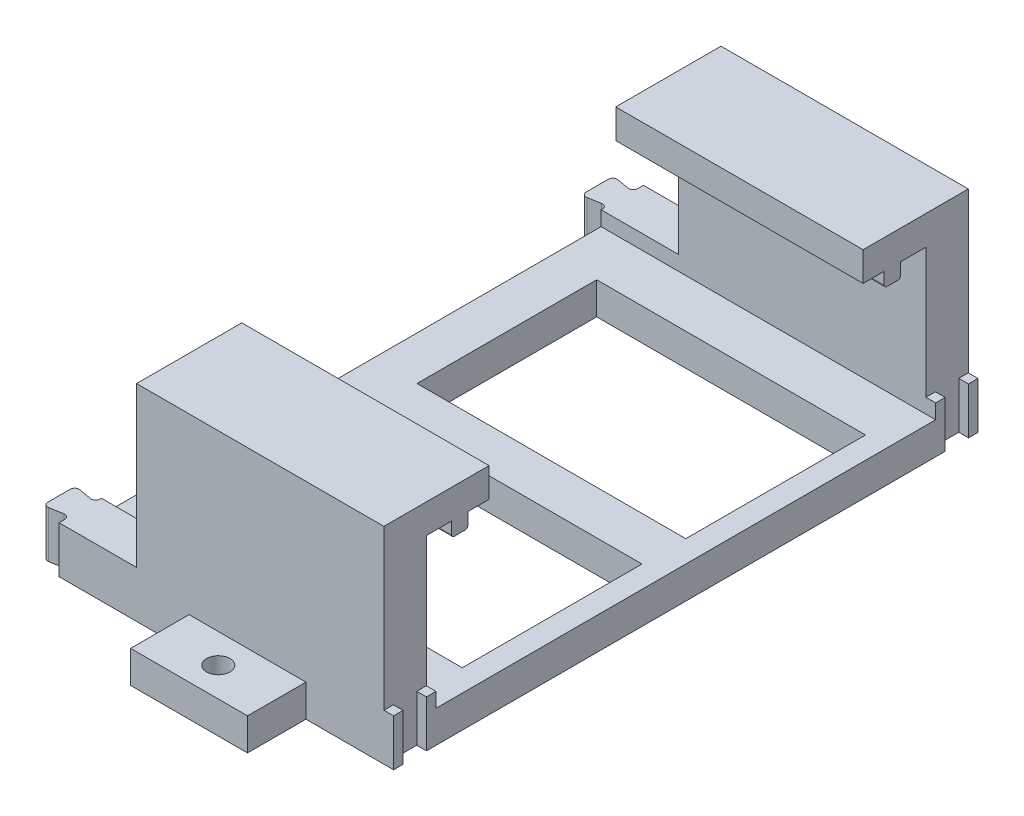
ISO-10303-21;
HEADER;
FILE_DESCRIPTION(('STEP AP214'),'2;1');
FILE_NAME('part.step','',(''),(''),'','','');
FILE_SCHEMA(('AUTOMOTIVE_DESIGN { 1 0 10303 214 1 1 1 1 }'));
ENDSEC;
DATA;
#1=APPLICATION_CONTEXT('core data for automotive mechanical design processes');
#2=APPLICATION_PROTOCOL_DEFINITION('international standard','automotive_design',2000,#1);
#3=PRODUCT_CONTEXT('',#1,'mechanical');
#4=PRODUCT('Part','Part','',(#3));
#5=PRODUCT_RELATED_PRODUCT_CATEGORY('part','',(#4));
#6=PRODUCT_DEFINITION_FORMATION('','',#4);
#7=PRODUCT_DEFINITION_CONTEXT('part definition',#1,'design');
#8=PRODUCT_DEFINITION('design','',#6,#7);
#9=PRODUCT_DEFINITION_SHAPE('','',#8);
#10=(LENGTH_UNIT() NAMED_UNIT(*) SI_UNIT(.MILLI.,.METRE.));
#11=(NAMED_UNIT(*) PLANE_ANGLE_UNIT() SI_UNIT($,.RADIAN.));
#12=(NAMED_UNIT(*) SI_UNIT($,.STERADIAN.) SOLID_ANGLE_UNIT());
#13=UNCERTAINTY_MEASURE_WITH_UNIT(LENGTH_MEASURE(1.E-05),#10,'distance_accuracy_value','');
#14=(GEOMETRIC_REPRESENTATION_CONTEXT(3) GLOBAL_UNCERTAINTY_ASSIGNED_CONTEXT((#13)) GLOBAL_UNIT_ASSIGNED_CONTEXT((#10,
#11,#12)) REPRESENTATION_CONTEXT('',''));
#15=CARTESIAN_POINT('',(0.,0.,0.));
#16=DIRECTION('',(0.,0.,1.));
#17=DIRECTION('',(1.,0.,0.));
#18=AXIS2_PLACEMENT_3D('',#15,#16,#17);
#19=CARTESIAN_POINT('',(0.,16.,0.));
#20=DIRECTION('',(0.,-1.,0.));
#21=DIRECTION('',(0.,0.,-1.));
#22=AXIS2_PLACEMENT_3D('',#19,#20,#21);
#23=PLANE('',#22);
#24=DIRECTION('',(-1.,0.,0.));
#25=VECTOR('',#24,1.);
#26=CARTESIAN_POINT('',(70.,16.,-88.75));
#27=LINE('',#26,#25);
#28=CARTESIAN_POINT('',(70.,16.,-88.75));
#29=VERTEX_POINT('',#28);
#30=CARTESIAN_POINT('',(66.6758873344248,16.,-88.75));
#31=VERTEX_POINT('',#30);
#32=EDGE_CURVE('E519',#29,#31,#27,.T.);
#33=ORIENTED_EDGE('',*,*,#32,.T.);
#34=DIRECTION('',(0.,0.,-1.));
#35=VECTOR('',#34,1.);
#36=CARTESIAN_POINT('',(66.6758873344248,16.,-64.));
#37=LINE('',#36,#35);
#38=CARTESIAN_POINT('',(66.6758873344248,16.,-85.5));
#39=VERTEX_POINT('',#38);
#40=EDGE_CURVE('E617',#39,#31,#37,.T.);
#41=ORIENTED_EDGE('',*,*,#40,.F.);
#42=DIRECTION('',(-1.,0.,0.));
#43=VECTOR('',#42,1.);
#44=CARTESIAN_POINT('',(0.,16.,-85.5));
#45=LINE('',#44,#43);
#46=CARTESIAN_POINT('',(70.,16.,-85.5));
#47=VERTEX_POINT('',#46);
#48=EDGE_CURVE('E691',#47,#39,#45,.T.);
#49=ORIENTED_EDGE('',*,*,#48,.F.);
#50=DIRECTION('',(0.,0.,-1.));
#51=VECTOR('',#50,1.);
#52=CARTESIAN_POINT('',(70.,16.,120.));
#53=LINE('',#52,#51);
#54=EDGE_CURVE('E591',#47,#29,#53,.T.);
#55=ORIENTED_EDGE('',*,*,#54,.T.);
#56=EDGE_LOOP('',(#33,#41,#49,#55));
#57=FACE_BOUND('',#56,.T.);
#58=ADVANCED_FACE('F45',(#57),#23,.F.);
#59=DIRECTION('',(1.,0.,0.));
#60=VECTOR('',#59,1.);
#61=CARTESIAN_POINT('',(70.,16.,-96.75));
#62=LINE('',#61,#60);
#63=CARTESIAN_POINT('',(66.6758873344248,16.,-96.75));
#64=VERTEX_POINT('',#63);
#65=CARTESIAN_POINT('',(70.,16.,-96.75));
#66=VERTEX_POINT('',#65);
#67=EDGE_CURVE('E509',#64,#66,#62,.T.);
#68=ORIENTED_EDGE('',*,*,#67,.T.);
#69=CARTESIAN_POINT('',(70.,16.,-100.));
#70=VERTEX_POINT('',#69);
#71=EDGE_CURVE('E596',#66,#70,#53,.T.);
#72=ORIENTED_EDGE('',*,*,#71,.T.);
#73=DIRECTION('',(-1.,0.,0.));
#74=VECTOR('',#73,1.);
#75=CARTESIAN_POINT('',(-184.5,16.,-100.));
#76=LINE('',#75,#74);
#77=CARTESIAN_POINT('',(66.6758873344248,16.,-100.));
#78=VERTEX_POINT('',#77);
#79=EDGE_CURVE('E1087',#70,#78,#76,.T.);
#80=ORIENTED_EDGE('',*,*,#79,.T.);
#81=EDGE_CURVE('E621',#64,#78,#37,.T.);
#82=ORIENTED_EDGE('',*,*,#81,.F.);
#83=EDGE_LOOP('',(#68,#72,#80,#82));
#84=FACE_BOUND('',#83,.T.);
#85=ADVANCED_FACE('F1292',(#84),#23,.F.);
#86=CARTESIAN_POINT('',(0.,0.,0.));
#87=DIRECTION('',(0.,-1.,0.));
#88=DIRECTION('',(0.,0.,-1.));
#89=AXIS2_PLACEMENT_3D('',#86,#87,#88);
#90=PLANE('',#89);
#91=CARTESIAN_POINT('',(20.,0.,-110.));
#92=DIRECTION('',(0.,1.,0.));
#93=DIRECTION('',(0.,0.,1.));
#94=AXIS2_PLACEMENT_3D('',#91,#92,#93);
#95=CIRCLE('',#94,4.);
#96=CARTESIAN_POINT('',(20.,0.,-106.));
#97=VERTEX_POINT('',#96);
#98=EDGE_CURVE('E903',#97,#97,#95,.T.);
#99=ORIENTED_EDGE('',*,*,#98,.T.);
#100=EDGE_LOOP('',(#99));
#101=FACE_BOUND('',#100,.T.);
#102=CARTESIAN_POINT('',(20.,0.,110.));
#103=DIRECTION('',(0.,-1.,0.));
#104=DIRECTION('',(0.,0.,-1.));
#105=AXIS2_PLACEMENT_3D('',#102,#103,#104);
#106=CIRCLE('',#105,4.);
#107=CARTESIAN_POINT('',(20.,0.,106.));
#108=VERTEX_POINT('',#107);
#109=EDGE_CURVE('E819',#108,#108,#106,.T.);
#110=ORIENTED_EDGE('',*,*,#109,.F.);
#111=EDGE_LOOP('',(#110));
#112=FACE_BOUND('',#111,.T.);
#113=DIRECTION('',(0.,0.,1.));
#114=VECTOR('',#113,1.);
#115=CARTESIAN_POINT('',(-29.5,0.,-7.5));
#116=LINE('',#115,#114);
#117=CARTESIAN_POINT('',(-29.5,0.,-69.));
#118=VERTEX_POINT('',#117);
#119=CARTESIAN_POINT('',(-29.5,0.,-7.5));
#120=VERTEX_POINT('',#119);
#121=EDGE_CURVE('E775',#118,#120,#116,.T.);
#122=ORIENTED_EDGE('',*,*,#121,.T.);
#123=DIRECTION('',(1.,0.,0.));
#124=VECTOR('',#123,1.);
#125=CARTESIAN_POINT('',(-29.5,0.,-7.5));
#126=LINE('',#125,#124);
#127=CARTESIAN_POINT('',(62.5,0.,-7.5));
#128=VERTEX_POINT('',#127);
#129=EDGE_CURVE('E779',#120,#128,#126,.T.);
#130=ORIENTED_EDGE('',*,*,#129,.T.);
#131=DIRECTION('',(0.,0.,-1.));
#132=VECTOR('',#131,1.);
#133=CARTESIAN_POINT('',(62.5,0.,-7.5));
#134=LINE('',#133,#132);
#135=CARTESIAN_POINT('',(62.5,0.,-69.));
#136=VERTEX_POINT('',#135);
#137=EDGE_CURVE('E784',#128,#136,#134,.T.);
#138=ORIENTED_EDGE('',*,*,#137,.T.);
#139=DIRECTION('',(-1.,0.,0.));
#140=VECTOR('',#139,1.);
#141=CARTESIAN_POINT('',(-29.5,0.,-69.));
#142=LINE('',#141,#140);
#143=EDGE_CURVE('E788',#136,#118,#142,.T.);
#144=ORIENTED_EDGE('',*,*,#143,.T.);
#145=EDGE_LOOP('',(#122,#130,#138,#144));
#146=FACE_BOUND('',#145,.T.);
#147=DIRECTION('',(0.,0.,-1.));
#148=VECTOR('',#147,1.);
#149=CARTESIAN_POINT('',(62.5,0.,7.5));
#150=LINE('',#149,#148);
#151=CARTESIAN_POINT('',(62.5,0.,69.));
#152=VERTEX_POINT('',#151);
#153=CARTESIAN_POINT('',(62.5,0.,7.5));
#154=VERTEX_POINT('',#153);
#155=EDGE_CURVE('E749',#152,#154,#150,.T.);
#156=ORIENTED_EDGE('',*,*,#155,.T.);
#157=DIRECTION('',(-1.,0.,0.));
#158=VECTOR('',#157,1.);
#159=CARTESIAN_POINT('',(62.5,0.,7.5));
#160=LINE('',#159,#158);
#161=CARTESIAN_POINT('',(-29.5,0.,7.50000000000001));
#162=VERTEX_POINT('',#161);
#163=EDGE_CURVE('E768',#154,#162,#160,.T.);
#164=ORIENTED_EDGE('',*,*,#163,.T.);
#165=DIRECTION('',(0.,0.,1.));
#166=VECTOR('',#165,1.);
#167=CARTESIAN_POINT('',(-29.5,0.,7.50000000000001));
#168=LINE('',#167,#166);
#169=CARTESIAN_POINT('',(-29.5,0.,69.));
#170=VERTEX_POINT('',#169);
#171=EDGE_CURVE('E764',#162,#170,#168,.T.);
#172=ORIENTED_EDGE('',*,*,#171,.T.);
#173=DIRECTION('',(1.,0.,0.));
#174=VECTOR('',#173,1.);
#175=CARTESIAN_POINT('',(62.5,0.,69.));
#176=LINE('',#175,#174);
#177=EDGE_CURVE('E735',#170,#152,#176,.T.);
#178=ORIENTED_EDGE('',*,*,#177,.T.);
#179=EDGE_LOOP('',(#156,#164,#172,#178));
#180=FACE_BOUND('',#179,.T.);
#181=DIRECTION('',(0.,0.,-1.));
#182=VECTOR('',#181,1.);
#183=CARTESIAN_POINT('',(66.6758873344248,0.,-88.75));
#184=LINE('',#183,#182);
#185=CARTESIAN_POINT('',(66.6758873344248,0.,-88.75));
#186=VERTEX_POINT('',#185);
#187=CARTESIAN_POINT('',(66.6758873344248,0.,-96.75));
#188=VERTEX_POINT('',#187);
#189=EDGE_CURVE('E497',#186,#188,#184,.T.);
#190=ORIENTED_EDGE('',*,*,#189,.F.);
#191=DIRECTION('',(-1.,0.,0.));
#192=VECTOR('',#191,1.);
#193=CARTESIAN_POINT('',(70.,0.,-88.75));
#194=LINE('',#193,#192);
#195=CARTESIAN_POINT('',(70.,0.,-88.75));
#196=VERTEX_POINT('',#195);
#197=EDGE_CURVE('E505',#196,#186,#194,.T.);
#198=ORIENTED_EDGE('',*,*,#197,.F.);
#199=DIRECTION('',(0.,0.,1.));
#200=VECTOR('',#199,1.);
#201=CARTESIAN_POINT('',(70.,0.,120.));
#202=LINE('',#201,#200);
#203=CARTESIAN_POINT('',(70.,0.,88.75));
#204=VERTEX_POINT('',#203);
#205=EDGE_CURVE('E69',#196,#204,#202,.T.);
#206=ORIENTED_EDGE('',*,*,#205,.T.);
#207=DIRECTION('',(-1.,0.,0.));
#208=VECTOR('',#207,1.);
#209=CARTESIAN_POINT('',(70.,0.,88.75));
#210=LINE('',#209,#208);
#211=CARTESIAN_POINT('',(66.6758873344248,0.,88.75));
#212=VERTEX_POINT('',#211);
#213=EDGE_CURVE('E538',#204,#212,#210,.T.);
#214=ORIENTED_EDGE('',*,*,#213,.T.);
#215=DIRECTION('',(0.,0.,1.));
#216=VECTOR('',#215,1.);
#217=CARTESIAN_POINT('',(66.6758873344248,0.,88.75));
#218=LINE('',#217,#216);
#219=CARTESIAN_POINT('',(66.6758873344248,0.,96.75));
#220=VERTEX_POINT('',#219);
#221=EDGE_CURVE('E541',#212,#220,#218,.T.);
#222=ORIENTED_EDGE('',*,*,#221,.T.);
#223=DIRECTION('',(1.,0.,0.));
#224=VECTOR('',#223,1.);
#225=CARTESIAN_POINT('',(70.,0.,96.75));
#226=LINE('',#225,#224);
#227=CARTESIAN_POINT('',(70.,0.,96.75));
#228=VERTEX_POINT('',#227);
#229=EDGE_CURVE('E546',#220,#228,#226,.T.);
#230=ORIENTED_EDGE('',*,*,#229,.T.);
#231=CARTESIAN_POINT('',(70.,0.,100.));
#232=VERTEX_POINT('',#231);
#233=EDGE_CURVE('E590',#228,#232,#202,.T.);
#234=ORIENTED_EDGE('',*,*,#233,.T.);
#235=DIRECTION('',(1.,0.,0.));
#236=VECTOR('',#235,1.);
#237=CARTESIAN_POINT('',(-184.5,0.,100.));
#238=LINE('',#237,#236);
#239=CARTESIAN_POINT('',(40.,0.,100.));
#240=VERTEX_POINT('',#239);
#241=EDGE_CURVE('E1101',#240,#232,#238,.T.);
#242=ORIENTED_EDGE('',*,*,#241,.F.);
#243=DIRECTION('',(0.,0.,-1.));
#244=VECTOR('',#243,1.);
#245=CARTESIAN_POINT('',(40.,0.,120.));
#246=LINE('',#245,#244);
#247=CARTESIAN_POINT('',(40.,0.,120.));
#248=VERTEX_POINT('',#247);
#249=EDGE_CURVE('E860',#248,#240,#246,.T.);
#250=ORIENTED_EDGE('',*,*,#249,.F.);
#251=DIRECTION('',(-1.,0.,0.));
#252=VECTOR('',#251,1.);
#253=CARTESIAN_POINT('',(0.,0.,120.));
#254=LINE('',#253,#252);
#255=CARTESIAN_POINT('',(0.,0.,120.));
#256=VERTEX_POINT('',#255);
#257=EDGE_CURVE('E831',#248,#256,#254,.T.);
#258=ORIENTED_EDGE('',*,*,#257,.T.);
#259=DIRECTION('',(0.,0.,-1.));
#260=VECTOR('',#259,1.);
#261=CARTESIAN_POINT('',(0.,0.,120.));
#262=LINE('',#261,#260);
#263=CARTESIAN_POINT('',(0.,0.,100.));
#264=VERTEX_POINT('',#263);
#265=EDGE_CURVE('E863',#256,#264,#262,.T.);
#266=ORIENTED_EDGE('',*,*,#265,.T.);
#267=CARTESIAN_POINT('',(-44.5,0.,100.));
#268=VERTEX_POINT('',#267);
#269=EDGE_CURVE('E1102',#268,#264,#238,.T.);
#270=ORIENTED_EDGE('',*,*,#269,.F.);
#271=DIRECTION('',(0.,0.,-1.));
#272=VECTOR('',#271,1.);
#273=CARTESIAN_POINT('',(-44.5,0.,-100.));
#274=LINE('',#273,#272);
#275=CARTESIAN_POINT('',(-44.5,0.,98.0076303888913));
#276=VERTEX_POINT('',#275);
#277=EDGE_CURVE('E1074',#268,#276,#274,.T.);
#278=ORIENTED_EDGE('',*,*,#277,.T.);
#279=CARTESIAN_POINT('',(-46.,0.,98.0076303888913));
#280=DIRECTION('',(0.,-1.,0.));
#281=DIRECTION('',(0.,0.,-1.));
#282=AXIS2_PLACEMENT_3D('',#279,#280,#281);
#283=CIRCLE('',#282,1.5);
#284=CARTESIAN_POINT('',(-46.2604722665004,0.,96.530418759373));
#285=VERTEX_POINT('',#284);
#286=EDGE_CURVE('E1179',#276,#285,#283,.F.);
#287=ORIENTED_EDGE('',*,*,#286,.T.);
#288=DIRECTION('',(0.984807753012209,0.,-0.173648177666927));
#289=VECTOR('',#288,1.);
#290=CARTESIAN_POINT('',(-44.5,0.,96.22));
#291=LINE('',#290,#289);
#292=CARTESIAN_POINT('',(-50.7395277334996,0.,97.3201970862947));
#293=VERTEX_POINT('',#292);
#294=EDGE_CURVE('E1049',#293,#285,#291,.T.);
#295=ORIENTED_EDGE('',*,*,#294,.F.);
#296=CARTESIAN_POINT('',(-51.,0.,95.8429854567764));
#297=DIRECTION('',(0.,-1.,0.));
#298=DIRECTION('',(0.,0.,-1.));
#299=AXIS2_PLACEMENT_3D('',#296,#297,#298);
#300=CIRCLE('',#299,1.5);
#301=CARTESIAN_POINT('',(-52.5,0.,95.8429854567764));
#302=VERTEX_POINT('',#301);
#303=EDGE_CURVE('E1135',#293,#302,#300,.T.);
#304=ORIENTED_EDGE('',*,*,#303,.T.);
#305=DIRECTION('',(0.,0.,1.));
#306=VECTOR('',#305,1.);
#307=CARTESIAN_POINT('',(-52.5,0.,97.6306158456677));
#308=LINE('',#307,#306);
#309=CARTESIAN_POINT('',(-52.5,0.,88.1570145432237));
#310=VERTEX_POINT('',#309);
#311=EDGE_CURVE('E1053',#310,#302,#308,.T.);
#312=ORIENTED_EDGE('',*,*,#311,.F.);
#313=CARTESIAN_POINT('',(-51.,0.,88.1570145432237));
#314=DIRECTION('',(0.,-1.,0.));
#315=DIRECTION('',(0.,0.,-1.));
#316=AXIS2_PLACEMENT_3D('',#313,#314,#315);
#317=CIRCLE('',#316,1.5);
#318=CARTESIAN_POINT('',(-50.7395277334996,0.,86.6798029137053));
#319=VERTEX_POINT('',#318);
#320=EDGE_CURVE('E1138',#310,#319,#317,.T.);
#321=ORIENTED_EDGE('',*,*,#320,.T.);
#322=DIRECTION('',(-0.984807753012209,0.,-0.173648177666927));
#323=VECTOR('',#322,1.);
#324=CARTESIAN_POINT('',(-52.5,0.,86.3693841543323));
#325=LINE('',#324,#323);
#326=CARTESIAN_POINT('',(-46.2604722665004,0.,87.469581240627));
#327=VERTEX_POINT('',#326);
#328=EDGE_CURVE('E1057',#327,#319,#325,.T.);
#329=ORIENTED_EDGE('',*,*,#328,.F.);
#330=CARTESIAN_POINT('',(-46.,0.,85.9923696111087));
#331=DIRECTION('',(0.,-1.,0.));
#332=DIRECTION('',(0.,0.,-1.));
#333=AXIS2_PLACEMENT_3D('',#330,#331,#332);
#334=CIRCLE('',#333,1.5);
#335=CARTESIAN_POINT('',(-44.5,0.,85.9923696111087));
#336=VERTEX_POINT('',#335);
#337=EDGE_CURVE('E1176',#327,#336,#334,.F.);
#338=ORIENTED_EDGE('',*,*,#337,.T.);
#339=CARTESIAN_POINT('',(-44.5,0.,-85.9923696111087));
#340=VERTEX_POINT('',#339);
#341=EDGE_CURVE('E1079',#336,#340,#274,.T.);
#342=ORIENTED_EDGE('',*,*,#341,.T.);
#343=CARTESIAN_POINT('',(-46.,0.,-85.9923696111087));
#344=DIRECTION('',(0.,-1.,0.));
#345=DIRECTION('',(0.,0.,-1.));
#346=AXIS2_PLACEMENT_3D('',#343,#344,#345);
#347=CIRCLE('',#346,1.5);
#348=CARTESIAN_POINT('',(-46.2604722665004,0.,-87.469581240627));
#349=VERTEX_POINT('',#348);
#350=EDGE_CURVE('E1185',#340,#349,#347,.F.);
#351=ORIENTED_EDGE('',*,*,#350,.T.);
#352=DIRECTION('',(0.984807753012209,0.,-0.173648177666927));
#353=VECTOR('',#352,1.);
#354=CARTESIAN_POINT('',(-44.5,0.,-87.78));
#355=LINE('',#354,#353);
#356=CARTESIAN_POINT('',(-50.5395277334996,0.,-86.715068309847));
#357=VERTEX_POINT('',#356);
#358=EDGE_CURVE('E1069',#357,#349,#355,.T.);
#359=ORIENTED_EDGE('',*,*,#358,.F.);
#360=CARTESIAN_POINT('',(-50.8,0.,-88.1922799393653));
#361=DIRECTION('',(0.,-1.,0.));
#362=DIRECTION('',(0.,0.,-1.));
#363=AXIS2_PLACEMENT_3D('',#360,#361,#362);
#364=CIRCLE('',#363,1.5);
#365=CARTESIAN_POINT('',(-52.3,0.,-88.1922799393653));
#366=VERTEX_POINT('',#365);
#367=EDGE_CURVE('E1132',#357,#366,#364,.T.);
#368=ORIENTED_EDGE('',*,*,#367,.T.);
#369=DIRECTION('',(0.,0.,1.));
#370=VECTOR('',#369,1.);
#371=CARTESIAN_POINT('',(-52.3,0.,-86.404649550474));
#372=LINE('',#371,#370);
#373=CARTESIAN_POINT('',(-52.3,0.,-95.8077200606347));
#374=VERTEX_POINT('',#373);
#375=EDGE_CURVE('E1065',#374,#366,#372,.T.);
#376=ORIENTED_EDGE('',*,*,#375,.F.);
#377=CARTESIAN_POINT('',(-50.8,0.,-95.8077200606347));
#378=DIRECTION('',(0.,-1.,0.));
#379=DIRECTION('',(0.,0.,-1.));
#380=AXIS2_PLACEMENT_3D('',#377,#378,#379);
#381=CIRCLE('',#380,1.5);
#382=CARTESIAN_POINT('',(-50.5395277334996,0.,-97.284931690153));
#383=VERTEX_POINT('',#382);
#384=EDGE_CURVE('E1129',#374,#383,#381,.T.);
#385=ORIENTED_EDGE('',*,*,#384,.T.);
#386=DIRECTION('',(-0.984807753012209,0.,-0.173648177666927));
#387=VECTOR('',#386,1.);
#388=CARTESIAN_POINT('',(-52.3,0.,-97.595350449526));
#389=LINE('',#388,#387);
#390=CARTESIAN_POINT('',(-46.2604722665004,0.,-96.530418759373));
#391=VERTEX_POINT('',#390);
#392=EDGE_CURVE('E1061',#391,#383,#389,.T.);
#393=ORIENTED_EDGE('',*,*,#392,.F.);
#394=CARTESIAN_POINT('',(-46.,0.,-98.0076303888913));
#395=DIRECTION('',(0.,-1.,0.));
#396=DIRECTION('',(0.,0.,-1.));
#397=AXIS2_PLACEMENT_3D('',#394,#395,#396);
#398=CIRCLE('',#397,1.5);
#399=CARTESIAN_POINT('',(-44.5,0.,-98.0076303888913));
#400=VERTEX_POINT('',#399);
#401=EDGE_CURVE('E1182',#391,#400,#398,.F.);
#402=ORIENTED_EDGE('',*,*,#401,.T.);
#403=CARTESIAN_POINT('',(-44.5,0.,-100.));
#404=VERTEX_POINT('',#403);
#405=EDGE_CURVE('E1073',#400,#404,#274,.T.);
#406=ORIENTED_EDGE('',*,*,#405,.T.);
#407=DIRECTION('',(-1.,0.,0.));
#408=VECTOR('',#407,1.);
#409=CARTESIAN_POINT('',(-184.5,0.,-100.));
#410=LINE('',#409,#408);
#411=CARTESIAN_POINT('',(0.,0.,-100.));
#412=VERTEX_POINT('',#411);
#413=EDGE_CURVE('E1086',#412,#404,#410,.T.);
#414=ORIENTED_EDGE('',*,*,#413,.F.);
#415=DIRECTION('',(0.,0.,1.));
#416=VECTOR('',#415,1.);
#417=CARTESIAN_POINT('',(0.,0.,-120.));
#418=LINE('',#417,#416);
#419=CARTESIAN_POINT('',(0.,0.,-120.));
#420=VERTEX_POINT('',#419);
#421=EDGE_CURVE('E926',#420,#412,#418,.T.);
#422=ORIENTED_EDGE('',*,*,#421,.F.);
#423=DIRECTION('',(-1.,0.,0.));
#424=VECTOR('',#423,1.);
#425=CARTESIAN_POINT('',(0.,0.,-120.));
#426=LINE('',#425,#424);
#427=CARTESIAN_POINT('',(40.,0.,-120.));
#428=VERTEX_POINT('',#427);
#429=EDGE_CURVE('E923',#428,#420,#426,.T.);
#430=ORIENTED_EDGE('',*,*,#429,.F.);
#431=DIRECTION('',(0.,0.,1.));
#432=VECTOR('',#431,1.);
#433=CARTESIAN_POINT('',(40.,0.,-120.));
#434=LINE('',#433,#432);
#435=CARTESIAN_POINT('',(40.,0.,-100.));
#436=VERTEX_POINT('',#435);
#437=EDGE_CURVE('E940',#428,#436,#434,.T.);
#438=ORIENTED_EDGE('',*,*,#437,.T.);
#439=CARTESIAN_POINT('',(70.,0.,-100.));
#440=VERTEX_POINT('',#439);
#441=EDGE_CURVE('E1098',#440,#436,#410,.T.);
#442=ORIENTED_EDGE('',*,*,#441,.F.);
#443=CARTESIAN_POINT('',(70.,0.,-96.75));
#444=VERTEX_POINT('',#443);
#445=EDGE_CURVE('E517',#440,#444,#202,.T.);
#446=ORIENTED_EDGE('',*,*,#445,.T.);
#447=DIRECTION('',(1.,0.,0.));
#448=VECTOR('',#447,1.);
#449=CARTESIAN_POINT('',(70.,0.,-96.75));
#450=LINE('',#449,#448);
#451=EDGE_CURVE('E61',#188,#444,#450,.T.);
#452=ORIENTED_EDGE('',*,*,#451,.F.);
#453=EDGE_LOOP('',(#190,#198,#206,#214,#222,#230,#234,#242,#250,#258,#266,#270,#278,#287,#295,
#304,#312,#321,#329,#338,#342,#351,#359,#368,#376,#385,#393,#402,#406,#414,#422,#430,#438,#442,
#446,#452));
#454=FACE_BOUND('',#453,.T.);
#455=ADVANCED_FACE('F515',(#101,#112,#146,#180,#454),#90,.T.);
#456=CARTESIAN_POINT('',(70.,281.913989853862,120.));
#457=DIRECTION('',(1.,0.,0.));
#458=DIRECTION('',(0.,0.,-1.));
#459=AXIS2_PLACEMENT_3D('',#456,#457,#458);
#460=PLANE('',#459);
#461=ORIENTED_EDGE('',*,*,#205,.F.);
#462=DIRECTION('',(0.,1.,0.));
#463=VECTOR('',#462,1.);
#464=CARTESIAN_POINT('',(70.,0.,-88.75));
#465=LINE('',#464,#463);
#466=EDGE_CURVE('E529',#196,#29,#465,.T.);
#467=ORIENTED_EDGE('',*,*,#466,.T.);
#468=ORIENTED_EDGE('',*,*,#54,.F.);
#469=DIRECTION('',(0.,1.,0.));
#470=VECTOR('',#469,1.);
#471=CARTESIAN_POINT('',(70.,60.5,-85.5));
#472=LINE('',#471,#470);
#473=CARTESIAN_POINT('',(70.,11.,-85.5));
#474=VERTEX_POINT('',#473);
#475=EDGE_CURVE('E604',#474,#47,#472,.T.);
#476=ORIENTED_EDGE('',*,*,#475,.F.);
#477=DIRECTION('',(0.,0.,-1.));
#478=VECTOR('',#477,1.);
#479=CARTESIAN_POINT('',(70.,11.,0.));
#480=LINE('',#479,#478);
#481=CARTESIAN_POINT('',(70.,11.,85.5));
#482=VERTEX_POINT('',#481);
#483=EDGE_CURVE('E600',#482,#474,#480,.T.);
#484=ORIENTED_EDGE('',*,*,#483,.F.);
#485=DIRECTION('',(0.,1.,0.));
#486=VECTOR('',#485,1.);
#487=CARTESIAN_POINT('',(70.,60.5,85.5));
#488=LINE('',#487,#486);
#489=CARTESIAN_POINT('',(70.,16.,85.5));
#490=VERTEX_POINT('',#489);
#491=EDGE_CURVE('E54',#482,#490,#488,.T.);
#492=ORIENTED_EDGE('',*,*,#491,.T.);
#493=CARTESIAN_POINT('',(70.,16.,88.75));
#494=VERTEX_POINT('',#493);
#495=EDGE_CURVE('E595',#494,#490,#53,.T.);
#496=ORIENTED_EDGE('',*,*,#495,.F.);
#497=DIRECTION('',(0.,1.,0.));
#498=VECTOR('',#497,1.);
#499=CARTESIAN_POINT('',(70.,0.,88.75));
#500=LINE('',#499,#498);
#501=EDGE_CURVE('E550',#204,#494,#500,.T.);
#502=ORIENTED_EDGE('',*,*,#501,.F.);
#503=EDGE_LOOP('',(#461,#467,#468,#476,#484,#492,#496,#502));
#504=FACE_BOUND('',#503,.T.);
#505=ADVANCED_FACE('F1245',(#504),#460,.T.);
#506=ORIENTED_EDGE('',*,*,#71,.F.);
#507=DIRECTION('',(0.,1.,0.));
#508=VECTOR('',#507,1.);
#509=CARTESIAN_POINT('',(70.,0.,-96.75));
#510=LINE('',#509,#508);
#511=EDGE_CURVE('E512',#444,#66,#510,.T.);
#512=ORIENTED_EDGE('',*,*,#511,.F.);
#513=ORIENTED_EDGE('',*,*,#445,.F.);
#514=DIRECTION('',(0.,1.,0.));
#515=VECTOR('',#514,1.);
#516=CARTESIAN_POINT('',(70.,16.,-100.));
#517=LINE('',#516,#515);
#518=EDGE_CURVE('E612',#440,#70,#517,.T.);
#519=ORIENTED_EDGE('',*,*,#518,.T.);
#520=EDGE_LOOP('',(#506,#512,#513,#519));
#521=FACE_BOUND('',#520,.T.);
#522=ADVANCED_FACE('F1297',(#521),#460,.T.);
#523=CARTESIAN_POINT('',(70.,16.,100.));
#524=VERTEX_POINT('',#523);
#525=CARTESIAN_POINT('',(70.,16.,96.75));
#526=VERTEX_POINT('',#525);
#527=EDGE_CURVE('E597',#524,#526,#53,.T.);
#528=ORIENTED_EDGE('',*,*,#527,.T.);
#529=DIRECTION('',(1.,0.,0.));
#530=VECTOR('',#529,1.);
#531=CARTESIAN_POINT('',(70.,16.,96.75));
#532=LINE('',#531,#530);
#533=CARTESIAN_POINT('',(66.6758873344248,16.,96.75));
#534=VERTEX_POINT('',#533);
#535=EDGE_CURVE('E542',#534,#526,#532,.T.);
#536=ORIENTED_EDGE('',*,*,#535,.F.);
#537=DIRECTION('',(0.,0.,1.));
#538=VECTOR('',#537,1.);
#539=CARTESIAN_POINT('',(66.6758873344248,16.,64.));
#540=LINE('',#539,#538);
#541=CARTESIAN_POINT('',(66.6758873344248,16.,100.));
#542=VERTEX_POINT('',#541);
#543=EDGE_CURVE('E658',#534,#542,#540,.T.);
#544=ORIENTED_EDGE('',*,*,#543,.T.);
#545=DIRECTION('',(1.,0.,0.));
#546=VECTOR('',#545,1.);
#547=CARTESIAN_POINT('',(-184.5,16.,100.));
#548=LINE('',#547,#546);
#549=EDGE_CURVE('E1091',#542,#524,#548,.T.);
#550=ORIENTED_EDGE('',*,*,#549,.T.);
#551=EDGE_LOOP('',(#528,#536,#544,#550));
#552=FACE_BOUND('',#551,.T.);
#553=ADVANCED_FACE('F1424',(#552),#23,.F.);
#554=DIRECTION('',(0.,1.,0.));
#555=VECTOR('',#554,1.);
#556=CARTESIAN_POINT('',(70.,0.,96.75));
#557=LINE('',#556,#555);
#558=EDGE_CURVE('E556',#228,#526,#557,.T.);
#559=ORIENTED_EDGE('',*,*,#558,.T.);
#560=ORIENTED_EDGE('',*,*,#527,.F.);
#561=DIRECTION('',(0.,-1.,0.));
#562=VECTOR('',#561,1.);
#563=CARTESIAN_POINT('',(70.,16.,100.));
#564=LINE('',#563,#562);
#565=EDGE_CURVE('E608',#524,#232,#564,.T.);
#566=ORIENTED_EDGE('',*,*,#565,.T.);
#567=ORIENTED_EDGE('',*,*,#233,.F.);
#568=EDGE_LOOP('',(#559,#560,#566,#567));
#569=FACE_BOUND('',#568,.T.);
#570=ADVANCED_FACE('F1268',(#569),#460,.T.);
#571=CARTESIAN_POINT('',(-184.5,16.,-100.));
#572=DIRECTION('',(0.,0.,1.));
#573=DIRECTION('',(1.,0.,0.));
#574=AXIS2_PLACEMENT_3D('',#571,#572,#573);
#575=PLANE('',#574);
#576=DIRECTION('',(0.,-1.,0.));
#577=VECTOR('',#576,1.);
#578=CARTESIAN_POINT('',(-17.966896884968,78.,-100.));
#579=LINE('',#578,#577);
#580=CARTESIAN_POINT('',(-17.966896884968,70.5,-100.));
#581=VERTEX_POINT('',#580);
#582=CARTESIAN_POINT('',(-17.966896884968,16.,-100.));
#583=VERTEX_POINT('',#582);
#584=EDGE_CURVE('E986',#581,#583,#579,.T.);
#585=ORIENTED_EDGE('',*,*,#584,.F.);
#586=DIRECTION('',(1.,0.,0.));
#587=VECTOR('',#586,1.);
#588=CARTESIAN_POINT('',(-184.5,70.5,-100.));
#589=LINE('',#588,#587);
#590=CARTESIAN_POINT('',(66.6758873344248,70.5,-100.));
#591=VERTEX_POINT('',#590);
#592=EDGE_CURVE('E586',#581,#591,#589,.T.);
#593=ORIENTED_EDGE('',*,*,#592,.T.);
#594=DIRECTION('',(0.,1.,0.));
#595=VECTOR('',#594,1.);
#596=CARTESIAN_POINT('',(66.6758873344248,-22.3516991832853,-100.));
#597=LINE('',#596,#595);
#598=EDGE_CURVE('E625',#78,#591,#597,.T.);
#599=ORIENTED_EDGE('',*,*,#598,.F.);
#600=ORIENTED_EDGE('',*,*,#79,.F.);
#601=ORIENTED_EDGE('',*,*,#518,.F.);
#602=ORIENTED_EDGE('',*,*,#441,.T.);
#603=DIRECTION('',(0.,-1.,0.));
#604=VECTOR('',#603,1.);
#605=CARTESIAN_POINT('',(40.,0.,-100.));
#606=LINE('',#605,#604);
#607=CARTESIAN_POINT('',(40.,11.,-100.));
#608=VERTEX_POINT('',#607);
#609=EDGE_CURVE('E917',#608,#436,#606,.T.);
#610=ORIENTED_EDGE('',*,*,#609,.F.);
#611=DIRECTION('',(1.,0.,0.));
#612=VECTOR('',#611,1.);
#613=CARTESIAN_POINT('',(0.,11.,-100.));
#614=LINE('',#613,#612);
#615=CARTESIAN_POINT('',(0.,11.,-100.));
#616=VERTEX_POINT('',#615);
#617=EDGE_CURVE('E930',#616,#608,#614,.T.);
#618=ORIENTED_EDGE('',*,*,#617,.F.);
#619=DIRECTION('',(0.,1.,0.));
#620=VECTOR('',#619,1.);
#621=CARTESIAN_POINT('',(0.,0.,-100.));
#622=LINE('',#621,#620);
#623=EDGE_CURVE('E908',#412,#616,#622,.T.);
#624=ORIENTED_EDGE('',*,*,#623,.F.);
#625=ORIENTED_EDGE('',*,*,#413,.T.);
#626=DIRECTION('',(0.,-1.,0.));
#627=VECTOR('',#626,1.);
#628=CARTESIAN_POINT('',(-44.5,28.,-100.));
#629=LINE('',#628,#627);
#630=CARTESIAN_POINT('',(-44.5,16.,-100.));
#631=VERTEX_POINT('',#630);
#632=EDGE_CURVE('E1078',#631,#404,#629,.T.);
#633=ORIENTED_EDGE('',*,*,#632,.F.);
#634=EDGE_CURVE('E1092',#583,#631,#76,.T.);
#635=ORIENTED_EDGE('',*,*,#634,.F.);
#636=EDGE_LOOP('',(#585,#593,#599,#600,#601,#602,#610,#618,#624,#625,#633,#635));
#637=FACE_BOUND('',#636,.T.);
#638=ADVANCED_FACE('F1300',(#637),#575,.F.);
#639=CARTESIAN_POINT('',(-52.5,60.5,-85.5));
#640=DIRECTION('',(0.,0.,1.));
#641=DIRECTION('',(0.,-1.,0.));
#642=AXIS2_PLACEMENT_3D('',#639,#640,#641);
#643=PLANE('',#642);
#644=DIRECTION('',(1.,0.,0.));
#645=VECTOR('',#644,1.);
#646=CARTESIAN_POINT('',(-52.5,11.,-85.5));
#647=LINE('',#646,#645);
#648=CARTESIAN_POINT('',(-44.5,11.,-85.5));
#649=VERTEX_POINT('',#648);
#650=EDGE_CURVE('E686',#649,#474,#647,.T.);
#651=ORIENTED_EDGE('',*,*,#650,.T.);
#652=ORIENTED_EDGE('',*,*,#475,.T.);
#653=ORIENTED_EDGE('',*,*,#48,.T.);
#654=DIRECTION('',(0.,1.,0.));
#655=VECTOR('',#654,1.);
#656=CARTESIAN_POINT('',(66.6758873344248,60.5,-85.5));
#657=LINE('',#656,#655);
#658=CARTESIAN_POINT('',(66.6758873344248,60.5,-85.5));
#659=VERTEX_POINT('',#658);
#660=EDGE_CURVE('E1236',#39,#659,#657,.T.);
#661=ORIENTED_EDGE('',*,*,#660,.T.);
#662=DIRECTION('',(1.,0.,0.));
#663=VECTOR('',#662,1.);
#664=CARTESIAN_POINT('',(-52.5,60.5,-85.5));
#665=LINE('',#664,#663);
#666=CARTESIAN_POINT('',(-17.966896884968,60.5,-85.5));
#667=VERTEX_POINT('',#666);
#668=EDGE_CURVE('E687',#667,#659,#665,.T.);
#669=ORIENTED_EDGE('',*,*,#668,.F.);
#670=DIRECTION('',(0.,-1.,0.));
#671=VECTOR('',#670,1.);
#672=CARTESIAN_POINT('',(-17.966896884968,78.,-85.5));
#673=LINE('',#672,#671);
#674=CARTESIAN_POINT('',(-17.966896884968,16.,-85.5));
#675=VERTEX_POINT('',#674);
#676=EDGE_CURVE('E697',#667,#675,#673,.T.);
#677=ORIENTED_EDGE('',*,*,#676,.T.);
#678=DIRECTION('',(-1.,0.,0.));
#679=VECTOR('',#678,1.);
#680=CARTESIAN_POINT('',(0.,16.,-85.5));
#681=LINE('',#680,#679);
#682=CARTESIAN_POINT('',(-44.5,16.,-85.5));
#683=VERTEX_POINT('',#682);
#684=EDGE_CURVE('E700',#675,#683,#681,.T.);
#685=ORIENTED_EDGE('',*,*,#684,.T.);
#686=DIRECTION('',(0.,-1.,0.));
#687=VECTOR('',#686,1.);
#688=CARTESIAN_POINT('',(-44.5,28.,-85.5));
#689=LINE('',#688,#687);
#690=EDGE_CURVE('E703',#683,#649,#689,.T.);
#691=ORIENTED_EDGE('',*,*,#690,.T.);
#692=EDGE_LOOP('',(#651,#652,#653,#661,#669,#677,#685,#691));
#693=FACE_BOUND('',#692,.T.);
#694=ADVANCED_FACE('F1346',(#693),#643,.T.);
#695=CARTESIAN_POINT('',(66.6758873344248,16.,85.5));
#696=VERTEX_POINT('',#695);
#697=CARTESIAN_POINT('',(66.6758873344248,16.,88.75));
#698=VERTEX_POINT('',#697);
#699=EDGE_CURVE('E653',#696,#698,#540,.T.);
#700=ORIENTED_EDGE('',*,*,#699,.T.);
#701=DIRECTION('',(-1.,0.,0.));
#702=VECTOR('',#701,1.);
#703=CARTESIAN_POINT('',(70.,16.,88.75));
#704=LINE('',#703,#702);
#705=EDGE_CURVE('E533',#494,#698,#704,.T.);
#706=ORIENTED_EDGE('',*,*,#705,.F.);
#707=ORIENTED_EDGE('',*,*,#495,.T.);
#708=DIRECTION('',(-1.,0.,0.));
#709=VECTOR('',#708,1.);
#710=CARTESIAN_POINT('',(0.,16.,85.5));
#711=LINE('',#710,#709);
#712=EDGE_CURVE('E712',#490,#696,#711,.T.);
#713=ORIENTED_EDGE('',*,*,#712,.T.);
#714=EDGE_LOOP('',(#700,#706,#707,#713));
#715=FACE_BOUND('',#714,.T.);
#716=ADVANCED_FACE('F1252',(#715),#23,.F.);
#717=CARTESIAN_POINT('',(-184.5,16.,100.));
#718=DIRECTION('',(0.,0.,-1.));
#719=DIRECTION('',(-1.,0.,0.));
#720=AXIS2_PLACEMENT_3D('',#717,#718,#719);
#721=PLANE('',#720);
#722=DIRECTION('',(0.,1.,0.));
#723=VECTOR('',#722,1.);
#724=CARTESIAN_POINT('',(66.6758873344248,-22.3516991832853,100.));
#725=LINE('',#724,#723);
#726=CARTESIAN_POINT('',(66.6758873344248,70.5,100.));
#727=VERTEX_POINT('',#726);
#728=EDGE_CURVE('E657',#542,#727,#725,.T.);
#729=ORIENTED_EDGE('',*,*,#728,.T.);
#730=DIRECTION('',(-1.,0.,0.));
#731=VECTOR('',#730,1.);
#732=CARTESIAN_POINT('',(-184.5,70.5,100.));
#733=LINE('',#732,#731);
#734=CARTESIAN_POINT('',(-17.966896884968,70.5,100.));
#735=VERTEX_POINT('',#734);
#736=EDGE_CURVE('E582',#727,#735,#733,.T.);
#737=ORIENTED_EDGE('',*,*,#736,.T.);
#738=DIRECTION('',(0.,-1.,0.));
#739=VECTOR('',#738,1.);
#740=CARTESIAN_POINT('',(-17.966896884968,78.,100.));
#741=LINE('',#740,#739);
#742=CARTESIAN_POINT('',(-17.966896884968,16.,100.));
#743=VERTEX_POINT('',#742);
#744=EDGE_CURVE('E900',#735,#743,#741,.T.);
#745=ORIENTED_EDGE('',*,*,#744,.T.);
#746=CARTESIAN_POINT('',(-44.5,16.,100.));
#747=VERTEX_POINT('',#746);
#748=EDGE_CURVE('E1093',#747,#743,#548,.T.);
#749=ORIENTED_EDGE('',*,*,#748,.F.);
#750=DIRECTION('',(0.,-1.,0.));
#751=VECTOR('',#750,1.);
#752=CARTESIAN_POINT('',(-44.5,28.,100.));
#753=LINE('',#752,#751);
#754=EDGE_CURVE('E1083',#747,#268,#753,.T.);
#755=ORIENTED_EDGE('',*,*,#754,.T.);
#756=ORIENTED_EDGE('',*,*,#269,.T.);
#757=DIRECTION('',(0.,1.,0.));
#758=VECTOR('',#757,1.);
#759=CARTESIAN_POINT('',(0.,0.,100.));
#760=LINE('',#759,#758);
#761=CARTESIAN_POINT('',(0.,11.,100.));
#762=VERTEX_POINT('',#761);
#763=EDGE_CURVE('E823',#264,#762,#760,.T.);
#764=ORIENTED_EDGE('',*,*,#763,.T.);
#765=DIRECTION('',(1.,0.,0.));
#766=VECTOR('',#765,1.);
#767=CARTESIAN_POINT('',(0.,11.,100.));
#768=LINE('',#767,#766);
#769=CARTESIAN_POINT('',(40.,11.,100.));
#770=VERTEX_POINT('',#769);
#771=EDGE_CURVE('E832',#762,#770,#768,.T.);
#772=ORIENTED_EDGE('',*,*,#771,.T.);
#773=DIRECTION('',(0.,-1.,0.));
#774=VECTOR('',#773,1.);
#775=CARTESIAN_POINT('',(40.,0.,100.));
#776=LINE('',#775,#774);
#777=EDGE_CURVE('E848',#770,#240,#776,.T.);
#778=ORIENTED_EDGE('',*,*,#777,.T.);
#779=ORIENTED_EDGE('',*,*,#241,.T.);
#780=ORIENTED_EDGE('',*,*,#565,.F.);
#781=ORIENTED_EDGE('',*,*,#549,.F.);
#782=EDGE_LOOP('',(#729,#737,#745,#749,#755,#756,#764,#772,#778,#779,#780,#781));
#783=FACE_BOUND('',#782,.T.);
#784=ADVANCED_FACE('F1273',(#783),#721,.F.);
#785=CARTESIAN_POINT('',(0.,11.,0.));
#786=DIRECTION('',(0.,1.,0.));
#787=DIRECTION('',(0.,0.,1.));
#788=AXIS2_PLACEMENT_3D('',#785,#786,#787);
#789=PLANE('',#788);
#790=DIRECTION('',(0.,0.,1.));
#791=VECTOR('',#790,1.);
#792=CARTESIAN_POINT('',(-29.5,11.,-7.5));
#793=LINE('',#792,#791);
#794=CARTESIAN_POINT('',(-29.5,11.,-69.));
#795=VERTEX_POINT('',#794);
#796=CARTESIAN_POINT('',(-29.5,11.,-7.5));
#797=VERTEX_POINT('',#796);
#798=EDGE_CURVE('E760',#795,#797,#793,.T.);
#799=ORIENTED_EDGE('',*,*,#798,.F.);
#800=DIRECTION('',(-1.,0.,0.));
#801=VECTOR('',#800,1.);
#802=CARTESIAN_POINT('',(-29.5,11.,-69.));
#803=LINE('',#802,#801);
#804=CARTESIAN_POINT('',(62.5,11.,-69.));
#805=VERTEX_POINT('',#804);
#806=EDGE_CURVE('E780',#805,#795,#803,.T.);
#807=ORIENTED_EDGE('',*,*,#806,.F.);
#808=DIRECTION('',(0.,0.,-1.));
#809=VECTOR('',#808,1.);
#810=CARTESIAN_POINT('',(62.5,11.,-7.5));
#811=LINE('',#810,#809);
#812=CARTESIAN_POINT('',(62.5,11.,-7.5));
#813=VERTEX_POINT('',#812);
#814=EDGE_CURVE('E799',#813,#805,#811,.T.);
#815=ORIENTED_EDGE('',*,*,#814,.F.);
#816=DIRECTION('',(1.,0.,0.));
#817=VECTOR('',#816,1.);
#818=CARTESIAN_POINT('',(-29.5,11.,-7.5));
#819=LINE('',#818,#817);
#820=EDGE_CURVE('E795',#797,#813,#819,.T.);
#821=ORIENTED_EDGE('',*,*,#820,.F.);
#822=EDGE_LOOP('',(#799,#807,#815,#821));
#823=FACE_BOUND('',#822,.T.);
#824=DIRECTION('',(0.,0.,-1.));
#825=VECTOR('',#824,1.);
#826=CARTESIAN_POINT('',(62.5,11.,7.5));
#827=LINE('',#826,#825);
#828=CARTESIAN_POINT('',(62.5,11.,69.));
#829=VERTEX_POINT('',#828);
#830=CARTESIAN_POINT('',(62.5,11.,7.5));
#831=VERTEX_POINT('',#830);
#832=EDGE_CURVE('E757',#829,#831,#827,.T.);
#833=ORIENTED_EDGE('',*,*,#832,.F.);
#834=DIRECTION('',(1.,0.,0.));
#835=VECTOR('',#834,1.);
#836=CARTESIAN_POINT('',(62.5,11.,69.));
#837=LINE('',#836,#835);
#838=CARTESIAN_POINT('',(-29.5,11.,69.));
#839=VERTEX_POINT('',#838);
#840=EDGE_CURVE('E744',#839,#829,#837,.T.);
#841=ORIENTED_EDGE('',*,*,#840,.F.);
#842=DIRECTION('',(0.,0.,1.));
#843=VECTOR('',#842,1.);
#844=CARTESIAN_POINT('',(-29.5,11.,7.50000000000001));
#845=LINE('',#844,#843);
#846=CARTESIAN_POINT('',(-29.5,11.,7.50000000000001));
#847=VERTEX_POINT('',#846);
#848=EDGE_CURVE('E748',#847,#839,#845,.T.);
#849=ORIENTED_EDGE('',*,*,#848,.F.);
#850=DIRECTION('',(-1.,0.,0.));
#851=VECTOR('',#850,1.);
#852=CARTESIAN_POINT('',(62.5,11.,7.5));
#853=LINE('',#852,#851);
#854=EDGE_CURVE('E753',#831,#847,#853,.T.);
#855=ORIENTED_EDGE('',*,*,#854,.F.);
#856=EDGE_LOOP('',(#833,#841,#849,#855));
#857=FACE_BOUND('',#856,.T.);
#858=DIRECTION('',(1.,0.,0.));
#859=VECTOR('',#858,1.);
#860=CARTESIAN_POINT('',(-52.5,11.,85.5));
#861=LINE('',#860,#859);
#862=CARTESIAN_POINT('',(-44.5,11.,85.5));
#863=VERTEX_POINT('',#862);
#864=EDGE_CURVE('E708',#863,#482,#861,.T.);
#865=ORIENTED_EDGE('',*,*,#864,.T.);
#866=ORIENTED_EDGE('',*,*,#483,.T.);
#867=ORIENTED_EDGE('',*,*,#650,.F.);
#868=DIRECTION('',(0.,0.,-1.));
#869=VECTOR('',#868,1.);
#870=CARTESIAN_POINT('',(-44.5,11.,0.));
#871=LINE('',#870,#869);
#872=EDGE_CURVE('E1097',#863,#649,#871,.T.);
#873=ORIENTED_EDGE('',*,*,#872,.F.);
#874=EDGE_LOOP('',(#865,#866,#867,#873));
#875=FACE_BOUND('',#874,.T.);
#876=ADVANCED_FACE('F1450',(#823,#857,#875),#789,.T.);
#877=CARTESIAN_POINT('',(-52.5,60.5,85.5));
#878=DIRECTION('',(0.,0.,1.));
#879=DIRECTION('',(0.,-1.,0.));
#880=AXIS2_PLACEMENT_3D('',#877,#878,#879);
#881=PLANE('',#880);
#882=ORIENTED_EDGE('',*,*,#491,.F.);
#883=ORIENTED_EDGE('',*,*,#864,.F.);
#884=DIRECTION('',(0.,-1.,0.));
#885=VECTOR('',#884,1.);
#886=CARTESIAN_POINT('',(-44.5,28.,85.5));
#887=LINE('',#886,#885);
#888=CARTESIAN_POINT('',(-44.5,16.,85.5));
#889=VERTEX_POINT('',#888);
#890=EDGE_CURVE('E726',#889,#863,#887,.T.);
#891=ORIENTED_EDGE('',*,*,#890,.F.);
#892=DIRECTION('',(-1.,0.,0.));
#893=VECTOR('',#892,1.);
#894=CARTESIAN_POINT('',(0.,16.,85.5));
#895=LINE('',#894,#893);
#896=CARTESIAN_POINT('',(-17.966896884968,16.,85.5));
#897=VERTEX_POINT('',#896);
#898=EDGE_CURVE('E722',#897,#889,#895,.T.);
#899=ORIENTED_EDGE('',*,*,#898,.F.);
#900=DIRECTION('',(0.,1.,0.));
#901=VECTOR('',#900,1.);
#902=CARTESIAN_POINT('',(-17.966896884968,78.,85.5));
#903=LINE('',#902,#901);
#904=CARTESIAN_POINT('',(-17.966896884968,60.5,85.5));
#905=VERTEX_POINT('',#904);
#906=EDGE_CURVE('E718',#897,#905,#903,.T.);
#907=ORIENTED_EDGE('',*,*,#906,.T.);
#908=DIRECTION('',(1.,0.,0.));
#909=VECTOR('',#908,1.);
#910=CARTESIAN_POINT('',(-52.5,60.5,85.5));
#911=LINE('',#910,#909);
#912=CARTESIAN_POINT('',(66.6758873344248,60.5,85.5));
#913=VERTEX_POINT('',#912);
#914=EDGE_CURVE('E707',#905,#913,#911,.T.);
#915=ORIENTED_EDGE('',*,*,#914,.T.);
#916=DIRECTION('',(0.,-1.,0.));
#917=VECTOR('',#916,1.);
#918=CARTESIAN_POINT('',(66.6758873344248,60.5,85.5));
#919=LINE('',#918,#917);
#920=EDGE_CURVE('E1232',#913,#696,#919,.T.);
#921=ORIENTED_EDGE('',*,*,#920,.T.);
#922=ORIENTED_EDGE('',*,*,#712,.F.);
#923=EDGE_LOOP('',(#882,#883,#891,#899,#907,#915,#921,#922));
#924=FACE_BOUND('',#923,.T.);
#925=ADVANCED_FACE('F1249',(#924),#881,.F.);
#926=CARTESIAN_POINT('',(-17.966896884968,60.5,-64.));
#927=DIRECTION('',(0.,1.,0.));
#928=DIRECTION('',(0.,0.,1.));
#929=AXIS2_PLACEMENT_3D('',#926,#927,#928);
#930=PLANE('',#929);
#931=DIRECTION('',(0.,0.,-1.));
#932=VECTOR('',#931,1.);
#933=CARTESIAN_POINT('',(66.6758873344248,60.5,-64.));
#934=LINE('',#933,#932);
#935=CARTESIAN_POINT('',(66.6758873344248,60.5,-76.85));
#936=VERTEX_POINT('',#935);
#937=EDGE_CURVE('E620',#936,#659,#934,.T.);
#938=ORIENTED_EDGE('',*,*,#937,.F.);
#939=DIRECTION('',(1.,0.,0.));
#940=VECTOR('',#939,1.);
#941=CARTESIAN_POINT('',(-17.966896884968,60.5,-76.85));
#942=LINE('',#941,#940);
#943=CARTESIAN_POINT('',(-17.966896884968,60.5,-76.85));
#944=VERTEX_POINT('',#943);
#945=EDGE_CURVE('E952',#944,#936,#942,.T.);
#946=ORIENTED_EDGE('',*,*,#945,.F.);
#947=DIRECTION('',(0.,0.,-1.));
#948=VECTOR('',#947,1.);
#949=CARTESIAN_POINT('',(-17.966896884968,60.5,-64.));
#950=LINE('',#949,#948);
#951=EDGE_CURVE('E977',#944,#667,#950,.T.);
#952=ORIENTED_EDGE('',*,*,#951,.T.);
#953=ORIENTED_EDGE('',*,*,#668,.T.);
#954=EDGE_LOOP('',(#938,#946,#952,#953));
#955=FACE_BOUND('',#954,.T.);
#956=ADVANCED_FACE('F1340',(#955),#930,.F.);
#957=DIRECTION('',(0.,0.,-1.));
#958=VECTOR('',#957,1.);
#959=CARTESIAN_POINT('',(66.6758873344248,60.5,-64.));
#960=LINE('',#959,#958);
#961=CARTESIAN_POINT('',(66.6758873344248,60.5,-64.));
#962=VERTEX_POINT('',#961);
#963=CARTESIAN_POINT('',(66.6758873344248,60.5,-71.2));
#964=VERTEX_POINT('',#963);
#965=EDGE_CURVE('E649',#962,#964,#960,.T.);
#966=ORIENTED_EDGE('',*,*,#965,.F.);
#967=DIRECTION('',(1.,0.,0.));
#968=VECTOR('',#967,1.);
#969=CARTESIAN_POINT('',(-17.966896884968,60.5,-64.));
#970=LINE('',#969,#968);
#971=CARTESIAN_POINT('',(-17.966896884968,60.5,-64.));
#972=VERTEX_POINT('',#971);
#973=EDGE_CURVE('E973',#972,#962,#970,.T.);
#974=ORIENTED_EDGE('',*,*,#973,.F.);
#975=CARTESIAN_POINT('',(-17.966896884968,60.5,-71.2));
#976=VERTEX_POINT('',#975);
#977=EDGE_CURVE('E978',#972,#976,#950,.T.);
#978=ORIENTED_EDGE('',*,*,#977,.T.);
#979=DIRECTION('',(-1.,0.,0.));
#980=VECTOR('',#979,1.);
#981=CARTESIAN_POINT('',(-17.966896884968,60.5,-71.2));
#982=LINE('',#981,#980);
#983=EDGE_CURVE('E958',#964,#976,#982,.T.);
#984=ORIENTED_EDGE('',*,*,#983,.F.);
#985=EDGE_LOOP('',(#966,#974,#978,#984));
#986=FACE_BOUND('',#985,.T.);
#987=ADVANCED_FACE('F1310',(#986),#930,.F.);
#988=CARTESIAN_POINT('',(0.,0.,-64.));
#989=DIRECTION('',(0.,0.,1.));
#990=DIRECTION('',(1.,0.,0.));
#991=AXIS2_PLACEMENT_3D('',#988,#989,#990);
#992=PLANE('',#991);
#993=DIRECTION('',(1.,0.,0.));
#994=VECTOR('',#993,1.);
#995=CARTESIAN_POINT('',(0.,70.5,-64.));
#996=LINE('',#995,#994);
#997=CARTESIAN_POINT('',(-17.966896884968,70.5,-64.));
#998=VERTEX_POINT('',#997);
#999=CARTESIAN_POINT('',(66.6758873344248,70.5,-64.));
#1000=VERTEX_POINT('',#999);
#1001=EDGE_CURVE('E579',#998,#1000,#996,.T.);
#1002=ORIENTED_EDGE('',*,*,#1001,.F.);
#1003=DIRECTION('',(0.,-1.,0.));
#1004=VECTOR('',#1003,1.);
#1005=CARTESIAN_POINT('',(-17.966896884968,78.,-64.));
#1006=LINE('',#1005,#1004);
#1007=EDGE_CURVE('E970',#998,#972,#1006,.T.);
#1008=ORIENTED_EDGE('',*,*,#1007,.T.);
#1009=ORIENTED_EDGE('',*,*,#973,.T.);
#1010=DIRECTION('',(0.,1.,0.));
#1011=VECTOR('',#1010,1.);
#1012=CARTESIAN_POINT('',(66.6758873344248,-22.3516991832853,-64.));
#1013=LINE('',#1012,#1011);
#1014=EDGE_CURVE('E616',#962,#1000,#1013,.T.);
#1015=ORIENTED_EDGE('',*,*,#1014,.T.);
#1016=EDGE_LOOP('',(#1002,#1008,#1009,#1015));
#1017=FACE_BOUND('',#1016,.T.);
#1018=ADVANCED_FACE('F1305',(#1017),#992,.T.);
#1019=CARTESIAN_POINT('',(-17.966896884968,55.5,-76.85));
#1020=DIRECTION('',(0.,0.,1.));
#1021=DIRECTION('',(1.,0.,0.));
#1022=AXIS2_PLACEMENT_3D('',#1019,#1020,#1021);
#1023=PLANE('',#1022);
#1024=DIRECTION('',(0.,1.,0.));
#1025=VECTOR('',#1024,1.);
#1026=CARTESIAN_POINT('',(66.6758873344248,55.5,-76.85));
#1027=LINE('',#1026,#1025);
#1028=CARTESIAN_POINT('',(66.6758873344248,56.5,-76.85));
#1029=VERTEX_POINT('',#1028);
#1030=EDGE_CURVE('E631',#1029,#936,#1027,.T.);
#1031=ORIENTED_EDGE('',*,*,#1030,.F.);
#1032=DIRECTION('',(1.,0.,0.));
#1033=VECTOR('',#1032,1.);
#1034=CARTESIAN_POINT('',(-17.966896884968,56.5,-76.85));
#1035=LINE('',#1034,#1033);
#1036=CARTESIAN_POINT('',(-17.966896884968,56.5,-76.85));
#1037=VERTEX_POINT('',#1036);
#1038=EDGE_CURVE('E1199',#1029,#1037,#1035,.F.);
#1039=ORIENTED_EDGE('',*,*,#1038,.T.);
#1040=DIRECTION('',(0.,1.,0.));
#1041=VECTOR('',#1040,1.);
#1042=CARTESIAN_POINT('',(-17.966896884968,55.5,-76.85));
#1043=LINE('',#1042,#1041);
#1044=EDGE_CURVE('E967',#1037,#944,#1043,.T.);
#1045=ORIENTED_EDGE('',*,*,#1044,.T.);
#1046=ORIENTED_EDGE('',*,*,#945,.T.);
#1047=EDGE_LOOP('',(#1031,#1039,#1045,#1046));
#1048=FACE_BOUND('',#1047,.T.);
#1049=ADVANCED_FACE('F1335',(#1048),#1023,.F.);
#1050=CARTESIAN_POINT('',(-17.966896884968,55.5,-71.2));
#1051=DIRECTION('',(0.,0.,-1.));
#1052=DIRECTION('',(-1.,0.,0.));
#1053=AXIS2_PLACEMENT_3D('',#1050,#1051,#1052);
#1054=PLANE('',#1053);
#1055=DIRECTION('',(0.,-1.,0.));
#1056=VECTOR('',#1055,1.);
#1057=CARTESIAN_POINT('',(66.6758873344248,55.5,-71.2));
#1058=LINE('',#1057,#1056);
#1059=CARTESIAN_POINT('',(66.6758873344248,56.5,-71.2));
#1060=VERTEX_POINT('',#1059);
#1061=EDGE_CURVE('E646',#964,#1060,#1058,.T.);
#1062=ORIENTED_EDGE('',*,*,#1061,.F.);
#1063=ORIENTED_EDGE('',*,*,#983,.T.);
#1064=DIRECTION('',(0.,1.,0.));
#1065=VECTOR('',#1064,1.);
#1066=CARTESIAN_POINT('',(-17.966896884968,55.5,-71.2));
#1067=LINE('',#1066,#1065);
#1068=CARTESIAN_POINT('',(-17.966896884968,56.5,-71.2));
#1069=VERTEX_POINT('',#1068);
#1070=EDGE_CURVE('E957',#1069,#976,#1067,.T.);
#1071=ORIENTED_EDGE('',*,*,#1070,.F.);
#1072=DIRECTION('',(-1.,0.,0.));
#1073=VECTOR('',#1072,1.);
#1074=CARTESIAN_POINT('',(79.8990802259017,56.5,-71.2));
#1075=LINE('',#1074,#1073);
#1076=EDGE_CURVE('E1208',#1069,#1060,#1075,.F.);
#1077=ORIENTED_EDGE('',*,*,#1076,.T.);
#1078=EDGE_LOOP('',(#1062,#1063,#1071,#1077));
#1079=FACE_BOUND('',#1078,.T.);
#1080=ADVANCED_FACE('F1321',(#1079),#1054,.F.);
#1081=CARTESIAN_POINT('',(0.,55.5,0.));
#1082=DIRECTION('',(0.,-1.,0.));
#1083=DIRECTION('',(0.,0.,-1.));
#1084=AXIS2_PLACEMENT_3D('',#1081,#1082,#1083);
#1085=PLANE('',#1084);
#1086=DIRECTION('',(1.,0.,0.));
#1087=VECTOR('',#1086,1.);
#1088=CARTESIAN_POINT('',(79.8990802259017,55.5,-75.85));
#1089=LINE('',#1088,#1087);
#1090=CARTESIAN_POINT('',(-17.966896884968,55.5,-75.85));
#1091=VERTEX_POINT('',#1090);
#1092=CARTESIAN_POINT('',(66.6758873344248,55.5,-75.85));
#1093=VERTEX_POINT('',#1092);
#1094=EDGE_CURVE('E1195',#1091,#1093,#1089,.T.);
#1095=ORIENTED_EDGE('',*,*,#1094,.T.);
#1096=DIRECTION('',(0.,0.,1.));
#1097=VECTOR('',#1096,1.);
#1098=CARTESIAN_POINT('',(66.6758873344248,55.5,0.));
#1099=LINE('',#1098,#1097);
#1100=CARTESIAN_POINT('',(66.6758873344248,55.5,-72.2));
#1101=VERTEX_POINT('',#1100);
#1102=EDGE_CURVE('E638',#1093,#1101,#1099,.T.);
#1103=ORIENTED_EDGE('',*,*,#1102,.T.);
#1104=DIRECTION('',(-1.,0.,0.));
#1105=VECTOR('',#1104,1.);
#1106=CARTESIAN_POINT('',(-17.966896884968,55.5,-72.2));
#1107=LINE('',#1106,#1105);
#1108=CARTESIAN_POINT('',(-17.966896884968,55.5,-72.2));
#1109=VERTEX_POINT('',#1108);
#1110=EDGE_CURVE('E1192',#1101,#1109,#1107,.T.);
#1111=ORIENTED_EDGE('',*,*,#1110,.T.);
#1112=DIRECTION('',(0.,0.,-1.));
#1113=VECTOR('',#1112,1.);
#1114=CARTESIAN_POINT('',(-17.966896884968,55.5,-71.2));
#1115=LINE('',#1114,#1113);
#1116=EDGE_CURVE('E953',#1109,#1091,#1115,.T.);
#1117=ORIENTED_EDGE('',*,*,#1116,.T.);
#1118=EDGE_LOOP('',(#1095,#1103,#1111,#1117));
#1119=FACE_BOUND('',#1118,.T.);
#1120=ADVANCED_FACE('F1326',(#1119),#1085,.T.);
#1121=CARTESIAN_POINT('',(0.,56.5,-75.85));
#1122=DIRECTION('',(-1.,0.,0.));
#1123=DIRECTION('',(0.,0.,1.));
#1124=AXIS2_PLACEMENT_3D('',#1121,#1122,#1123);
#1125=CYLINDRICAL_SURFACE('',#1124,1.);
#1126=ORIENTED_EDGE('',*,*,#1038,.F.);
#1127=CARTESIAN_POINT('',(66.6758873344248,56.5,-75.85));
#1128=DIRECTION('',(1.,0.,0.));
#1129=DIRECTION('',(0.,0.,-1.));
#1130=AXIS2_PLACEMENT_3D('',#1127,#1128,#1129);
#1131=CIRCLE('',#1130,1.);
#1132=EDGE_CURVE('E634',#1029,#1093,#1131,.F.);
#1133=ORIENTED_EDGE('',*,*,#1132,.T.);
#1134=ORIENTED_EDGE('',*,*,#1094,.F.);
#1135=CARTESIAN_POINT('',(-17.966896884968,56.5,-75.85));
#1136=DIRECTION('',(1.,0.,0.));
#1137=DIRECTION('',(0.,0.,-1.));
#1138=AXIS2_PLACEMENT_3D('',#1135,#1136,#1137);
#1139=CIRCLE('',#1138,1.);
#1140=EDGE_CURVE('E1205',#1037,#1091,#1139,.F.);
#1141=ORIENTED_EDGE('',*,*,#1140,.F.);
#1142=EDGE_LOOP('',(#1126,#1133,#1134,#1141));
#1143=FACE_BOUND('',#1142,.T.);
#1144=ADVANCED_FACE('F1331',(#1143),#1125,.T.);
#1145=CARTESIAN_POINT('',(0.,56.5,-72.2));
#1146=DIRECTION('',(1.,0.,0.));
#1147=DIRECTION('',(0.,0.,-1.));
#1148=AXIS2_PLACEMENT_3D('',#1145,#1146,#1147);
#1149=CYLINDRICAL_SURFACE('',#1148,1.);
#1150=ORIENTED_EDGE('',*,*,#1110,.F.);
#1151=CARTESIAN_POINT('',(66.6758873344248,56.5,-72.2));
#1152=DIRECTION('',(1.,0.,0.));
#1153=DIRECTION('',(0.,0.,-1.));
#1154=AXIS2_PLACEMENT_3D('',#1151,#1152,#1153);
#1155=CIRCLE('',#1154,1.);
#1156=EDGE_CURVE('E642',#1101,#1060,#1155,.F.);
#1157=ORIENTED_EDGE('',*,*,#1156,.T.);
#1158=ORIENTED_EDGE('',*,*,#1076,.F.);
#1159=CARTESIAN_POINT('',(-17.966896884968,56.5,-72.2));
#1160=DIRECTION('',(1.,0.,0.));
#1161=DIRECTION('',(0.,0.,-1.));
#1162=AXIS2_PLACEMENT_3D('',#1159,#1160,#1161);
#1163=CIRCLE('',#1162,1.);
#1164=EDGE_CURVE('E1202',#1109,#1069,#1163,.F.);
#1165=ORIENTED_EDGE('',*,*,#1164,.F.);
#1166=EDGE_LOOP('',(#1150,#1157,#1158,#1165));
#1167=FACE_BOUND('',#1166,.T.);
#1168=ADVANCED_FACE('F1324',(#1167),#1149,.T.);
#1169=ORIENTED_EDGE('',*,*,#684,.F.);
#1170=DIRECTION('',(0.,0.,1.));
#1171=VECTOR('',#1170,1.);
#1172=CARTESIAN_POINT('',(-17.966896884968,16.,-100.));
#1173=LINE('',#1172,#1171);
#1174=EDGE_CURVE('E982',#583,#675,#1173,.T.);
#1175=ORIENTED_EDGE('',*,*,#1174,.F.);
#1176=ORIENTED_EDGE('',*,*,#634,.T.);
#1177=DIRECTION('',(0.,0.,1.));
#1178=VECTOR('',#1177,1.);
#1179=CARTESIAN_POINT('',(-44.5,16.,100.));
#1180=LINE('',#1179,#1178);
#1181=CARTESIAN_POINT('',(-44.5,16.,-98.0076303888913));
#1182=VERTEX_POINT('',#1181);
#1183=EDGE_CURVE('E1008',#631,#1182,#1180,.T.);
#1184=ORIENTED_EDGE('',*,*,#1183,.T.);
#1185=CARTESIAN_POINT('',(-46.,16.,-98.0076303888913));
#1186=DIRECTION('',(0.,1.,0.));
#1187=DIRECTION('',(-1.,0.,0.));
#1188=AXIS2_PLACEMENT_3D('',#1185,#1186,#1187);
#1189=CIRCLE('',#1188,1.5);
#1190=CARTESIAN_POINT('',(-46.2604722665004,16.,-96.530418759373));
#1191=VERTEX_POINT('',#1190);
#1192=EDGE_CURVE('E1001',#1182,#1191,#1189,.F.);
#1193=ORIENTED_EDGE('',*,*,#1192,.T.);
#1194=DIRECTION('',(0.984807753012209,0.,0.173648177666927));
#1195=VECTOR('',#1194,1.);
#1196=CARTESIAN_POINT('',(-52.3,16.,-97.595350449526));
#1197=LINE('',#1196,#1195);
#1198=CARTESIAN_POINT('',(-50.5395277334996,16.,-97.284931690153));
#1199=VERTEX_POINT('',#1198);
#1200=EDGE_CURVE('E993',#1199,#1191,#1197,.T.);
#1201=ORIENTED_EDGE('',*,*,#1200,.F.);
#1202=CARTESIAN_POINT('',(-50.8,16.,-95.8077200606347));
#1203=DIRECTION('',(0.,1.,0.));
#1204=DIRECTION('',(-1.,0.,0.));
#1205=AXIS2_PLACEMENT_3D('',#1202,#1203,#1204);
#1206=CIRCLE('',#1205,1.5);
#1207=CARTESIAN_POINT('',(-52.3,16.,-95.8077200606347));
#1208=VERTEX_POINT('',#1207);
#1209=EDGE_CURVE('E1188',#1208,#1199,#1206,.F.);
#1210=ORIENTED_EDGE('',*,*,#1209,.F.);
#1211=DIRECTION('',(0.,0.,-1.));
#1212=VECTOR('',#1211,1.);
#1213=CARTESIAN_POINT('',(-52.3,16.,-86.404649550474));
#1214=LINE('',#1213,#1212);
#1215=CARTESIAN_POINT('',(-52.3,16.,-88.1922799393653));
#1216=VERTEX_POINT('',#1215);
#1217=EDGE_CURVE('E989',#1216,#1208,#1214,.T.);
#1218=ORIENTED_EDGE('',*,*,#1217,.F.);
#1219=CARTESIAN_POINT('',(-50.8,16.,-88.1922799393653));
#1220=DIRECTION('',(0.,1.,0.));
#1221=DIRECTION('',(-1.,0.,0.));
#1222=AXIS2_PLACEMENT_3D('',#1219,#1220,#1221);
#1223=CIRCLE('',#1222,1.5);
#1224=CARTESIAN_POINT('',(-50.5395277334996,16.,-86.715068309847));
#1225=VERTEX_POINT('',#1224);
#1226=EDGE_CURVE('E997',#1225,#1216,#1223,.F.);
#1227=ORIENTED_EDGE('',*,*,#1226,.F.);
#1228=DIRECTION('',(-0.984807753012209,0.,0.173648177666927));
#1229=VECTOR('',#1228,1.);
#1230=CARTESIAN_POINT('',(-44.5,16.,-87.78));
#1231=LINE('',#1230,#1229);
#1232=CARTESIAN_POINT('',(-46.2604722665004,16.,-87.469581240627));
#1233=VERTEX_POINT('',#1232);
#1234=EDGE_CURVE('E1004',#1233,#1225,#1231,.T.);
#1235=ORIENTED_EDGE('',*,*,#1234,.F.);
#1236=CARTESIAN_POINT('',(-46.,16.,-85.9923696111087));
#1237=DIRECTION('',(0.,1.,0.));
#1238=DIRECTION('',(-1.,0.,0.));
#1239=AXIS2_PLACEMENT_3D('',#1236,#1237,#1238);
#1240=CIRCLE('',#1239,1.5);
#1241=CARTESIAN_POINT('',(-44.5,16.,-85.9923696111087));
#1242=VERTEX_POINT('',#1241);
#1243=EDGE_CURVE('E1011',#1233,#1242,#1240,.F.);
#1244=ORIENTED_EDGE('',*,*,#1243,.T.);
#1245=DIRECTION('',(0.,0.,1.));
#1246=VECTOR('',#1245,1.);
#1247=CARTESIAN_POINT('',(-44.5,16.,100.));
#1248=LINE('',#1247,#1246);
#1249=EDGE_CURVE('E1014',#1242,#683,#1248,.T.);
#1250=ORIENTED_EDGE('',*,*,#1249,.T.);
#1251=EDGE_LOOP('',(#1169,#1175,#1176,#1184,#1193,#1201,#1210,#1218,#1227,#1235,#1244,#1250));
#1252=FACE_BOUND('',#1251,.T.);
#1253=ADVANCED_FACE('F1349',(#1252),#23,.F.);
#1254=CARTESIAN_POINT('',(-44.5,28.,100.));
#1255=DIRECTION('',(1.,0.,0.));
#1256=DIRECTION('',(0.,0.,-1.));
#1257=AXIS2_PLACEMENT_3D('',#1254,#1255,#1256);
#1258=PLANE('',#1257);
#1259=ORIENTED_EDGE('',*,*,#690,.F.);
#1260=ORIENTED_EDGE('',*,*,#1249,.F.);
#1261=DIRECTION('',(0.,1.,0.));
#1262=VECTOR('',#1261,1.);
#1263=CARTESIAN_POINT('',(-44.5,28.,-85.9923696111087));
#1264=LINE('',#1263,#1262);
#1265=EDGE_CURVE('E1108',#1242,#340,#1264,.F.);
#1266=ORIENTED_EDGE('',*,*,#1265,.T.);
#1267=ORIENTED_EDGE('',*,*,#341,.F.);
#1268=DIRECTION('',(0.,1.,0.));
#1269=VECTOR('',#1268,1.);
#1270=CARTESIAN_POINT('',(-44.5,28.,85.9923696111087));
#1271=LINE('',#1270,#1269);
#1272=CARTESIAN_POINT('',(-44.5,16.,85.9923696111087));
#1273=VERTEX_POINT('',#1272);
#1274=EDGE_CURVE('E1111',#336,#1273,#1271,.T.);
#1275=ORIENTED_EDGE('',*,*,#1274,.T.);
#1276=EDGE_CURVE('E1019',#889,#1273,#1248,.T.);
#1277=ORIENTED_EDGE('',*,*,#1276,.F.);
#1278=ORIENTED_EDGE('',*,*,#890,.T.);
#1279=ORIENTED_EDGE('',*,*,#872,.T.);
#1280=EDGE_LOOP('',(#1259,#1260,#1266,#1267,#1275,#1277,#1278,#1279));
#1281=FACE_BOUND('',#1280,.T.);
#1282=ADVANCED_FACE('F1355',(#1281),#1258,.F.);
#1283=CARTESIAN_POINT('',(-17.966896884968,78.,-100.));
#1284=DIRECTION('',(1.,0.,0.));
#1285=DIRECTION('',(0.,0.,-1.));
#1286=AXIS2_PLACEMENT_3D('',#1283,#1284,#1285);
#1287=PLANE('',#1286);
#1288=ORIENTED_EDGE('',*,*,#1007,.F.);
#1289=DIRECTION('',(0.,0.,1.));
#1290=VECTOR('',#1289,1.);
#1291=CARTESIAN_POINT('',(-17.966896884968,70.5,-120.));
#1292=LINE('',#1291,#1290);
#1293=EDGE_CURVE('E574',#581,#998,#1292,.T.);
#1294=ORIENTED_EDGE('',*,*,#1293,.F.);
#1295=ORIENTED_EDGE('',*,*,#584,.T.);
#1296=ORIENTED_EDGE('',*,*,#1174,.T.);
#1297=ORIENTED_EDGE('',*,*,#676,.F.);
#1298=ORIENTED_EDGE('',*,*,#951,.F.);
#1299=ORIENTED_EDGE('',*,*,#1044,.F.);
#1300=ORIENTED_EDGE('',*,*,#1140,.T.);
#1301=ORIENTED_EDGE('',*,*,#1116,.F.);
#1302=ORIENTED_EDGE('',*,*,#1164,.T.);
#1303=ORIENTED_EDGE('',*,*,#1070,.T.);
#1304=ORIENTED_EDGE('',*,*,#977,.F.);
#1305=EDGE_LOOP('',(#1288,#1294,#1295,#1296,#1297,#1298,#1299,#1300,#1301,#1302,#1303,#1304));
#1306=FACE_BOUND('',#1305,.T.);
#1307=ADVANCED_FACE('F1313',(#1306),#1287,.F.);
#1308=CARTESIAN_POINT('',(-17.966896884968,60.5,64.));
#1309=DIRECTION('',(0.,-1.,0.));
#1310=DIRECTION('',(0.,0.,-1.));
#1311=AXIS2_PLACEMENT_3D('',#1308,#1309,#1310);
#1312=PLANE('',#1311);
#1313=DIRECTION('',(0.,0.,-1.));
#1314=VECTOR('',#1313,1.);
#1315=CARTESIAN_POINT('',(66.6758873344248,60.5,64.));
#1316=LINE('',#1315,#1314);
#1317=CARTESIAN_POINT('',(66.6758873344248,60.5,71.2));
#1318=VERTEX_POINT('',#1317);
#1319=CARTESIAN_POINT('',(66.6758873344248,60.5,64.));
#1320=VERTEX_POINT('',#1319);
#1321=EDGE_CURVE('E683',#1318,#1320,#1316,.T.);
#1322=ORIENTED_EDGE('',*,*,#1321,.F.);
#1323=DIRECTION('',(-1.,0.,0.));
#1324=VECTOR('',#1323,1.);
#1325=CARTESIAN_POINT('',(-17.966896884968,60.5,71.2));
#1326=LINE('',#1325,#1324);
#1327=CARTESIAN_POINT('',(-17.966896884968,60.5,71.2));
#1328=VERTEX_POINT('',#1327);
#1329=EDGE_CURVE('E866',#1318,#1328,#1326,.T.);
#1330=ORIENTED_EDGE('',*,*,#1329,.T.);
#1331=DIRECTION('',(0.,0.,1.));
#1332=VECTOR('',#1331,1.);
#1333=CARTESIAN_POINT('',(-17.966896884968,60.5,64.));
#1334=LINE('',#1333,#1332);
#1335=CARTESIAN_POINT('',(-17.966896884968,60.5,64.));
#1336=VERTEX_POINT('',#1335);
#1337=EDGE_CURVE('E892',#1336,#1328,#1334,.T.);
#1338=ORIENTED_EDGE('',*,*,#1337,.F.);
#1339=DIRECTION('',(1.,0.,0.));
#1340=VECTOR('',#1339,1.);
#1341=CARTESIAN_POINT('',(-17.966896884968,60.5,64.));
#1342=LINE('',#1341,#1340);
#1343=EDGE_CURVE('E887',#1336,#1320,#1342,.T.);
#1344=ORIENTED_EDGE('',*,*,#1343,.T.);
#1345=EDGE_LOOP('',(#1322,#1330,#1338,#1344));
#1346=FACE_BOUND('',#1345,.T.);
#1347=ADVANCED_FACE('F1429',(#1346),#1312,.T.);
#1348=DIRECTION('',(0.,0.,-1.));
#1349=VECTOR('',#1348,1.);
#1350=CARTESIAN_POINT('',(-17.966896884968,16.,100.));
#1351=LINE('',#1350,#1349);
#1352=EDGE_CURVE('E896',#743,#897,#1351,.T.);
#1353=ORIENTED_EDGE('',*,*,#1352,.T.);
#1354=ORIENTED_EDGE('',*,*,#898,.T.);
#1355=ORIENTED_EDGE('',*,*,#1276,.T.);
#1356=CARTESIAN_POINT('',(-46.,16.,85.9923696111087));
#1357=DIRECTION('',(0.,1.,0.));
#1358=DIRECTION('',(-1.,0.,0.));
#1359=AXIS2_PLACEMENT_3D('',#1356,#1357,#1358);
#1360=CIRCLE('',#1359,1.5);
#1361=CARTESIAN_POINT('',(-46.2604722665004,16.,87.469581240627));
#1362=VERTEX_POINT('',#1361);
#1363=EDGE_CURVE('E1046',#1273,#1362,#1360,.F.);
#1364=ORIENTED_EDGE('',*,*,#1363,.T.);
#1365=DIRECTION('',(0.984807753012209,0.,0.173648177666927));
#1366=VECTOR('',#1365,1.);
#1367=CARTESIAN_POINT('',(-52.5,16.,86.3693841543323));
#1368=LINE('',#1367,#1366);
#1369=CARTESIAN_POINT('',(-50.7395277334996,16.,86.6798029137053));
#1370=VERTEX_POINT('',#1369);
#1371=EDGE_CURVE('E1042',#1370,#1362,#1368,.T.);
#1372=ORIENTED_EDGE('',*,*,#1371,.F.);
#1373=CARTESIAN_POINT('',(-51.,16.,88.1570145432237));
#1374=DIRECTION('',(0.,1.,0.));
#1375=DIRECTION('',(-1.,0.,0.));
#1376=AXIS2_PLACEMENT_3D('',#1373,#1374,#1375);
#1377=CIRCLE('',#1376,1.5);
#1378=CARTESIAN_POINT('',(-52.5,16.,88.1570145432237));
#1379=VERTEX_POINT('',#1378);
#1380=EDGE_CURVE('E1038',#1379,#1370,#1377,.F.);
#1381=ORIENTED_EDGE('',*,*,#1380,.F.);
#1382=DIRECTION('',(0.,0.,-1.));
#1383=VECTOR('',#1382,1.);
#1384=CARTESIAN_POINT('',(-52.5,16.,97.6306158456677));
#1385=LINE('',#1384,#1383);
#1386=CARTESIAN_POINT('',(-52.5,16.,95.8429854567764));
#1387=VERTEX_POINT('',#1386);
#1388=EDGE_CURVE('E1034',#1387,#1379,#1385,.T.);
#1389=ORIENTED_EDGE('',*,*,#1388,.F.);
#1390=CARTESIAN_POINT('',(-51.,16.,95.8429854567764));
#1391=DIRECTION('',(0.,1.,0.));
#1392=DIRECTION('',(-1.,0.,0.));
#1393=AXIS2_PLACEMENT_3D('',#1390,#1391,#1392);
#1394=CIRCLE('',#1393,1.5);
#1395=CARTESIAN_POINT('',(-50.7395277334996,16.,97.3201970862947));
#1396=VERTEX_POINT('',#1395);
#1397=EDGE_CURVE('E1030',#1396,#1387,#1394,.F.);
#1398=ORIENTED_EDGE('',*,*,#1397,.F.);
#1399=DIRECTION('',(-0.984807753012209,0.,0.173648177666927));
#1400=VECTOR('',#1399,1.);
#1401=CARTESIAN_POINT('',(-44.5,16.,96.22));
#1402=LINE('',#1401,#1400);
#1403=CARTESIAN_POINT('',(-46.2604722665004,16.,96.530418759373));
#1404=VERTEX_POINT('',#1403);
#1405=EDGE_CURVE('E1022',#1404,#1396,#1402,.T.);
#1406=ORIENTED_EDGE('',*,*,#1405,.F.);
#1407=CARTESIAN_POINT('',(-46.,16.,98.0076303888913));
#1408=DIRECTION('',(0.,1.,0.));
#1409=DIRECTION('',(-1.,0.,0.));
#1410=AXIS2_PLACEMENT_3D('',#1407,#1408,#1409);
#1411=CIRCLE('',#1410,1.5);
#1412=CARTESIAN_POINT('',(-44.5,16.,98.0076303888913));
#1413=VERTEX_POINT('',#1412);
#1414=EDGE_CURVE('E1018',#1404,#1413,#1411,.F.);
#1415=ORIENTED_EDGE('',*,*,#1414,.T.);
#1416=DIRECTION('',(0.,0.,1.));
#1417=VECTOR('',#1416,1.);
#1418=CARTESIAN_POINT('',(-44.5,16.,100.));
#1419=LINE('',#1418,#1417);
#1420=EDGE_CURVE('E1026',#1413,#747,#1419,.T.);
#1421=ORIENTED_EDGE('',*,*,#1420,.T.);
#1422=ORIENTED_EDGE('',*,*,#748,.T.);
#1423=EDGE_LOOP('',(#1353,#1354,#1355,#1364,#1372,#1381,#1389,#1398,#1406,#1415,#1421,#1422));
#1424=FACE_BOUND('',#1423,.T.);
#1425=ADVANCED_FACE('F1420',(#1424),#23,.F.);
#1426=ORIENTED_EDGE('',*,*,#1420,.F.);
#1427=DIRECTION('',(0.,1.,0.));
#1428=VECTOR('',#1427,1.);
#1429=CARTESIAN_POINT('',(-44.5,28.,98.0076303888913));
#1430=LINE('',#1429,#1428);
#1431=EDGE_CURVE('E1148',#1413,#276,#1430,.F.);
#1432=ORIENTED_EDGE('',*,*,#1431,.T.);
#1433=ORIENTED_EDGE('',*,*,#277,.F.);
#1434=ORIENTED_EDGE('',*,*,#754,.F.);
#1435=EDGE_LOOP('',(#1426,#1432,#1433,#1434));
#1436=FACE_BOUND('',#1435,.T.);
#1437=ADVANCED_FACE('F1428',(#1436),#1258,.F.);
#1438=ORIENTED_EDGE('',*,*,#1183,.F.);
#1439=ORIENTED_EDGE('',*,*,#632,.T.);
#1440=ORIENTED_EDGE('',*,*,#405,.F.);
#1441=DIRECTION('',(0.,1.,0.));
#1442=VECTOR('',#1441,1.);
#1443=CARTESIAN_POINT('',(-44.5,28.,-98.0076303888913));
#1444=LINE('',#1443,#1442);
#1445=EDGE_CURVE('E1151',#400,#1182,#1444,.T.);
#1446=ORIENTED_EDGE('',*,*,#1445,.T.);
#1447=EDGE_LOOP('',(#1438,#1439,#1440,#1446));
#1448=FACE_BOUND('',#1447,.T.);
#1449=ADVANCED_FACE('F1390',(#1448),#1258,.F.);
#1450=CARTESIAN_POINT('',(-52.3,0.,-97.595350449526));
#1451=DIRECTION('',(0.173648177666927,0.,-0.984807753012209));
#1452=DIRECTION('',(-0.984807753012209,0.,-0.173648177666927));
#1453=AXIS2_PLACEMENT_3D('',#1450,#1451,#1452);
#1454=PLANE('',#1453);
#1455=DIRECTION('',(0.,1.,0.));
#1456=VECTOR('',#1455,1.);
#1457=CARTESIAN_POINT('',(-50.5395277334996,0.,-97.284931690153));
#1458=LINE('',#1457,#1456);
#1459=EDGE_CURVE('E1155',#383,#1199,#1458,.T.);
#1460=ORIENTED_EDGE('',*,*,#1459,.T.);
#1461=ORIENTED_EDGE('',*,*,#1200,.T.);
#1462=DIRECTION('',(0.,1.,0.));
#1463=VECTOR('',#1462,1.);
#1464=CARTESIAN_POINT('',(-46.2604722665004,0.,-96.530418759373));
#1465=LINE('',#1464,#1463);
#1466=EDGE_CURVE('E1159',#1191,#391,#1465,.F.);
#1467=ORIENTED_EDGE('',*,*,#1466,.T.);
#1468=ORIENTED_EDGE('',*,*,#392,.T.);
#1469=EDGE_LOOP('',(#1460,#1461,#1467,#1468));
#1470=FACE_BOUND('',#1469,.T.);
#1471=ADVANCED_FACE('F1380',(#1470),#1454,.T.);
#1472=CARTESIAN_POINT('',(-44.5,0.,-87.78));
#1473=DIRECTION('',(0.173648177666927,0.,0.984807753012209));
#1474=DIRECTION('',(0.984807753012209,0.,-0.173648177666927));
#1475=AXIS2_PLACEMENT_3D('',#1472,#1473,#1474);
#1476=PLANE('',#1475);
#1477=DIRECTION('',(0.,1.,0.));
#1478=VECTOR('',#1477,1.);
#1479=CARTESIAN_POINT('',(-46.2604722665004,0.,-87.469581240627));
#1480=LINE('',#1479,#1478);
#1481=EDGE_CURVE('E1165',#349,#1233,#1480,.T.);
#1482=ORIENTED_EDGE('',*,*,#1481,.T.);
#1483=ORIENTED_EDGE('',*,*,#1234,.T.);
#1484=DIRECTION('',(0.,1.,0.));
#1485=VECTOR('',#1484,1.);
#1486=CARTESIAN_POINT('',(-50.5395277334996,0.,-86.715068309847));
#1487=LINE('',#1486,#1485);
#1488=EDGE_CURVE('E1162',#1225,#357,#1487,.F.);
#1489=ORIENTED_EDGE('',*,*,#1488,.T.);
#1490=ORIENTED_EDGE('',*,*,#358,.T.);
#1491=EDGE_LOOP('',(#1482,#1483,#1489,#1490));
#1492=FACE_BOUND('',#1491,.T.);
#1493=ADVANCED_FACE('F1364',(#1492),#1476,.T.);
#1494=CARTESIAN_POINT('',(-52.3,0.,-86.404649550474));
#1495=DIRECTION('',(-1.,0.,0.));
#1496=DIRECTION('',(0.,0.,1.));
#1497=AXIS2_PLACEMENT_3D('',#1494,#1495,#1496);
#1498=PLANE('',#1497);
#1499=DIRECTION('',(0.,1.,0.));
#1500=VECTOR('',#1499,1.);
#1501=CARTESIAN_POINT('',(-52.3,0.,-88.1922799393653));
#1502=LINE('',#1501,#1500);
#1503=EDGE_CURVE('E1172',#366,#1216,#1502,.T.);
#1504=ORIENTED_EDGE('',*,*,#1503,.T.);
#1505=ORIENTED_EDGE('',*,*,#1217,.T.);
#1506=DIRECTION('',(0.,1.,0.));
#1507=VECTOR('',#1506,1.);
#1508=CARTESIAN_POINT('',(-52.3,0.,-95.8077200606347));
#1509=LINE('',#1508,#1507);
#1510=EDGE_CURVE('E1169',#1208,#374,#1509,.F.);
#1511=ORIENTED_EDGE('',*,*,#1510,.T.);
#1512=ORIENTED_EDGE('',*,*,#375,.T.);
#1513=EDGE_LOOP('',(#1504,#1505,#1511,#1512));
#1514=FACE_BOUND('',#1513,.T.);
#1515=ADVANCED_FACE('F1372',(#1514),#1498,.T.);
#1516=CARTESIAN_POINT('',(-52.5,0.,86.3693841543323));
#1517=DIRECTION('',(0.173648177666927,0.,-0.984807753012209));
#1518=DIRECTION('',(-0.984807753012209,0.,-0.173648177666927));
#1519=AXIS2_PLACEMENT_3D('',#1516,#1517,#1518);
#1520=PLANE('',#1519);
#1521=DIRECTION('',(0.,1.,0.));
#1522=VECTOR('',#1521,1.);
#1523=CARTESIAN_POINT('',(-50.7395277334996,0.,86.6798029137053));
#1524=LINE('',#1523,#1522);
#1525=EDGE_CURVE('E1115',#319,#1370,#1524,.T.);
#1526=ORIENTED_EDGE('',*,*,#1525,.T.);
#1527=ORIENTED_EDGE('',*,*,#1371,.T.);
#1528=DIRECTION('',(0.,1.,0.));
#1529=VECTOR('',#1528,1.);
#1530=CARTESIAN_POINT('',(-46.2604722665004,0.,87.469581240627));
#1531=LINE('',#1530,#1529);
#1532=EDGE_CURVE('E1119',#1362,#327,#1531,.F.);
#1533=ORIENTED_EDGE('',*,*,#1532,.T.);
#1534=ORIENTED_EDGE('',*,*,#328,.T.);
#1535=EDGE_LOOP('',(#1526,#1527,#1533,#1534));
#1536=FACE_BOUND('',#1535,.T.);
#1537=ADVANCED_FACE('F1516',(#1536),#1520,.T.);
#1538=CARTESIAN_POINT('',(-44.5,0.,96.22));
#1539=DIRECTION('',(0.173648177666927,0.,0.984807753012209));
#1540=DIRECTION('',(0.984807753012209,0.,-0.173648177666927));
#1541=AXIS2_PLACEMENT_3D('',#1538,#1539,#1540);
#1542=PLANE('',#1541);
#1543=DIRECTION('',(0.,1.,0.));
#1544=VECTOR('',#1543,1.);
#1545=CARTESIAN_POINT('',(-46.2604722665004,0.,96.530418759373));
#1546=LINE('',#1545,#1544);
#1547=EDGE_CURVE('E1141',#285,#1404,#1546,.T.);
#1548=ORIENTED_EDGE('',*,*,#1547,.T.);
#1549=ORIENTED_EDGE('',*,*,#1405,.T.);
#1550=DIRECTION('',(0.,1.,0.));
#1551=VECTOR('',#1550,1.);
#1552=CARTESIAN_POINT('',(-50.7395277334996,0.,97.3201970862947));
#1553=LINE('',#1552,#1551);
#1554=EDGE_CURVE('E1145',#1396,#293,#1553,.F.);
#1555=ORIENTED_EDGE('',*,*,#1554,.T.);
#1556=ORIENTED_EDGE('',*,*,#294,.T.);
#1557=EDGE_LOOP('',(#1548,#1549,#1555,#1556));
#1558=FACE_BOUND('',#1557,.T.);
#1559=ADVANCED_FACE('F1533',(#1558),#1542,.T.);
#1560=CARTESIAN_POINT('',(-52.5,0.,97.6306158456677));
#1561=DIRECTION('',(-1.,0.,0.));
#1562=DIRECTION('',(0.,0.,1.));
#1563=AXIS2_PLACEMENT_3D('',#1560,#1561,#1562);
#1564=PLANE('',#1563);
#1565=DIRECTION('',(0.,1.,0.));
#1566=VECTOR('',#1565,1.);
#1567=CARTESIAN_POINT('',(-52.5,0.,95.8429854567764));
#1568=LINE('',#1567,#1566);
#1569=EDGE_CURVE('E1122',#302,#1387,#1568,.T.);
#1570=ORIENTED_EDGE('',*,*,#1569,.T.);
#1571=ORIENTED_EDGE('',*,*,#1388,.T.);
#1572=DIRECTION('',(0.,1.,0.));
#1573=VECTOR('',#1572,1.);
#1574=CARTESIAN_POINT('',(-52.5,0.,88.1570145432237));
#1575=LINE('',#1574,#1573);
#1576=EDGE_CURVE('E1126',#1379,#310,#1575,.F.);
#1577=ORIENTED_EDGE('',*,*,#1576,.T.);
#1578=ORIENTED_EDGE('',*,*,#311,.T.);
#1579=EDGE_LOOP('',(#1570,#1571,#1577,#1578));
#1580=FACE_BOUND('',#1579,.T.);
#1581=ADVANCED_FACE('F1524',(#1580),#1564,.T.);
#1582=CARTESIAN_POINT('',(-46.,28.,85.9923696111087));
#1583=DIRECTION('',(0.,1.,0.));
#1584=DIRECTION('',(0.,0.,1.));
#1585=AXIS2_PLACEMENT_3D('',#1582,#1583,#1584);
#1586=CYLINDRICAL_SURFACE('',#1585,1.5);
#1587=ORIENTED_EDGE('',*,*,#1363,.F.);
#1588=ORIENTED_EDGE('',*,*,#1274,.F.);
#1589=ORIENTED_EDGE('',*,*,#337,.F.);
#1590=ORIENTED_EDGE('',*,*,#1532,.F.);
#1591=EDGE_LOOP('',(#1587,#1588,#1589,#1590));
#1592=FACE_BOUND('',#1591,.T.);
#1593=ADVANCED_FACE('F1513',(#1592),#1586,.F.);
#1594=CARTESIAN_POINT('',(-51.,0.,88.1570145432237));
#1595=DIRECTION('',(0.,1.,0.));
#1596=DIRECTION('',(0.,0.,1.));
#1597=AXIS2_PLACEMENT_3D('',#1594,#1595,#1596);
#1598=CYLINDRICAL_SURFACE('',#1597,1.5);
#1599=ORIENTED_EDGE('',*,*,#1576,.F.);
#1600=ORIENTED_EDGE('',*,*,#1380,.T.);
#1601=ORIENTED_EDGE('',*,*,#1525,.F.);
#1602=ORIENTED_EDGE('',*,*,#320,.F.);
#1603=EDGE_LOOP('',(#1599,#1600,#1601,#1602));
#1604=FACE_BOUND('',#1603,.T.);
#1605=ADVANCED_FACE('F1522',(#1604),#1598,.T.);
#1606=CARTESIAN_POINT('',(-51.,0.,95.8429854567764));
#1607=DIRECTION('',(0.,1.,0.));
#1608=DIRECTION('',(0.,0.,1.));
#1609=AXIS2_PLACEMENT_3D('',#1606,#1607,#1608);
#1610=CYLINDRICAL_SURFACE('',#1609,1.5);
#1611=ORIENTED_EDGE('',*,*,#1554,.F.);
#1612=ORIENTED_EDGE('',*,*,#1397,.T.);
#1613=ORIENTED_EDGE('',*,*,#1569,.F.);
#1614=ORIENTED_EDGE('',*,*,#303,.F.);
#1615=EDGE_LOOP('',(#1611,#1612,#1613,#1614));
#1616=FACE_BOUND('',#1615,.T.);
#1617=ADVANCED_FACE('F1530',(#1616),#1610,.T.);
#1618=CARTESIAN_POINT('',(-46.,0.,98.0076303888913));
#1619=DIRECTION('',(0.,1.,0.));
#1620=DIRECTION('',(0.,0.,1.));
#1621=AXIS2_PLACEMENT_3D('',#1618,#1619,#1620);
#1622=CYLINDRICAL_SURFACE('',#1621,1.5);
#1623=ORIENTED_EDGE('',*,*,#1414,.F.);
#1624=ORIENTED_EDGE('',*,*,#1547,.F.);
#1625=ORIENTED_EDGE('',*,*,#286,.F.);
#1626=ORIENTED_EDGE('',*,*,#1431,.F.);
#1627=EDGE_LOOP('',(#1623,#1624,#1625,#1626));
#1628=FACE_BOUND('',#1627,.T.);
#1629=ADVANCED_FACE('F1538',(#1628),#1622,.F.);
#1630=CARTESIAN_POINT('',(-46.,28.,-98.0076303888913));
#1631=DIRECTION('',(0.,1.,0.));
#1632=DIRECTION('',(0.,0.,1.));
#1633=AXIS2_PLACEMENT_3D('',#1630,#1631,#1632);
#1634=CYLINDRICAL_SURFACE('',#1633,1.5);
#1635=ORIENTED_EDGE('',*,*,#1192,.F.);
#1636=ORIENTED_EDGE('',*,*,#1445,.F.);
#1637=ORIENTED_EDGE('',*,*,#401,.F.);
#1638=ORIENTED_EDGE('',*,*,#1466,.F.);
#1639=EDGE_LOOP('',(#1635,#1636,#1637,#1638));
#1640=FACE_BOUND('',#1639,.T.);
#1641=ADVANCED_FACE('F1384',(#1640),#1634,.F.);
#1642=CARTESIAN_POINT('',(-46.,0.,-85.9923696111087));
#1643=DIRECTION('',(0.,1.,0.));
#1644=DIRECTION('',(0.,0.,1.));
#1645=AXIS2_PLACEMENT_3D('',#1642,#1643,#1644);
#1646=CYLINDRICAL_SURFACE('',#1645,1.5);
#1647=ORIENTED_EDGE('',*,*,#1243,.F.);
#1648=ORIENTED_EDGE('',*,*,#1481,.F.);
#1649=ORIENTED_EDGE('',*,*,#350,.F.);
#1650=ORIENTED_EDGE('',*,*,#1265,.F.);
#1651=EDGE_LOOP('',(#1647,#1648,#1649,#1650));
#1652=FACE_BOUND('',#1651,.T.);
#1653=ADVANCED_FACE('F1359',(#1652),#1646,.F.);
#1654=CARTESIAN_POINT('',(-50.8,0.,-88.1922799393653));
#1655=DIRECTION('',(0.,1.,0.));
#1656=DIRECTION('',(0.,0.,1.));
#1657=AXIS2_PLACEMENT_3D('',#1654,#1655,#1656);
#1658=CYLINDRICAL_SURFACE('',#1657,1.5);
#1659=ORIENTED_EDGE('',*,*,#1488,.F.);
#1660=ORIENTED_EDGE('',*,*,#1226,.T.);
#1661=ORIENTED_EDGE('',*,*,#1503,.F.);
#1662=ORIENTED_EDGE('',*,*,#367,.F.);
#1663=EDGE_LOOP('',(#1659,#1660,#1661,#1662));
#1664=FACE_BOUND('',#1663,.T.);
#1665=ADVANCED_FACE('F1367',(#1664),#1658,.T.);
#1666=CARTESIAN_POINT('',(-50.8,0.,-95.8077200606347));
#1667=DIRECTION('',(0.,1.,0.));
#1668=DIRECTION('',(0.,0.,1.));
#1669=AXIS2_PLACEMENT_3D('',#1666,#1667,#1668);
#1670=CYLINDRICAL_SURFACE('',#1669,1.5);
#1671=ORIENTED_EDGE('',*,*,#1510,.F.);
#1672=ORIENTED_EDGE('',*,*,#1209,.T.);
#1673=ORIENTED_EDGE('',*,*,#1459,.F.);
#1674=ORIENTED_EDGE('',*,*,#384,.F.);
#1675=EDGE_LOOP('',(#1671,#1672,#1673,#1674));
#1676=FACE_BOUND('',#1675,.T.);
#1677=ADVANCED_FACE('F1375',(#1676),#1670,.T.);
#1678=CARTESIAN_POINT('',(0.,0.,-120.));
#1679=DIRECTION('',(1.,0.,0.));
#1680=DIRECTION('',(0.,0.,-1.));
#1681=AXIS2_PLACEMENT_3D('',#1678,#1679,#1680);
#1682=PLANE('',#1681);
#1683=ORIENTED_EDGE('',*,*,#623,.T.);
#1684=DIRECTION('',(0.,0.,1.));
#1685=VECTOR('',#1684,1.);
#1686=CARTESIAN_POINT('',(0.,11.,-120.));
#1687=LINE('',#1686,#1685);
#1688=CARTESIAN_POINT('',(0.,11.,-120.));
#1689=VERTEX_POINT('',#1688);
#1690=EDGE_CURVE('E948',#1689,#616,#1687,.T.);
#1691=ORIENTED_EDGE('',*,*,#1690,.F.);
#1692=DIRECTION('',(0.,1.,0.));
#1693=VECTOR('',#1692,1.);
#1694=CARTESIAN_POINT('',(0.,0.,-120.));
#1695=LINE('',#1694,#1693);
#1696=EDGE_CURVE('E912',#420,#1689,#1695,.T.);
#1697=ORIENTED_EDGE('',*,*,#1696,.F.);
#1698=ORIENTED_EDGE('',*,*,#421,.T.);
#1699=EDGE_LOOP('',(#1683,#1691,#1697,#1698));
#1700=FACE_BOUND('',#1699,.T.);
#1701=ADVANCED_FACE('F1396',(#1700),#1682,.F.);
#1702=CARTESIAN_POINT('',(0.,11.,-120.));
#1703=DIRECTION('',(0.,-1.,0.));
#1704=DIRECTION('',(1.,0.,0.));
#1705=AXIS2_PLACEMENT_3D('',#1702,#1703,#1704);
#1706=PLANE('',#1705);
#1707=CARTESIAN_POINT('',(20.,11.,-110.));
#1708=DIRECTION('',(0.,1.,0.));
#1709=DIRECTION('',(0.,0.,1.));
#1710=AXIS2_PLACEMENT_3D('',#1707,#1708,#1709);
#1711=CIRCLE('',#1710,4.);
#1712=CARTESIAN_POINT('',(20.,11.,-106.));
#1713=VERTEX_POINT('',#1712);
#1714=EDGE_CURVE('E904',#1713,#1713,#1711,.T.);
#1715=ORIENTED_EDGE('',*,*,#1714,.F.);
#1716=EDGE_LOOP('',(#1715));
#1717=FACE_BOUND('',#1716,.T.);
#1718=ORIENTED_EDGE('',*,*,#617,.T.);
#1719=DIRECTION('',(0.,0.,1.));
#1720=VECTOR('',#1719,1.);
#1721=CARTESIAN_POINT('',(40.,11.,-120.));
#1722=LINE('',#1721,#1720);
#1723=CARTESIAN_POINT('',(40.,11.,-120.));
#1724=VERTEX_POINT('',#1723);
#1725=EDGE_CURVE('E944',#1724,#608,#1722,.T.);
#1726=ORIENTED_EDGE('',*,*,#1725,.F.);
#1727=DIRECTION('',(1.,0.,0.));
#1728=VECTOR('',#1727,1.);
#1729=CARTESIAN_POINT('',(0.,11.,-120.));
#1730=LINE('',#1729,#1728);
#1731=EDGE_CURVE('E916',#1689,#1724,#1730,.T.);
#1732=ORIENTED_EDGE('',*,*,#1731,.F.);
#1733=ORIENTED_EDGE('',*,*,#1690,.T.);
#1734=EDGE_LOOP('',(#1718,#1726,#1732,#1733));
#1735=FACE_BOUND('',#1734,.T.);
#1736=ADVANCED_FACE('F1406',(#1717,#1735),#1706,.F.);
#1737=CARTESIAN_POINT('',(40.,0.,-120.));
#1738=DIRECTION('',(-1.,0.,0.));
#1739=DIRECTION('',(0.,0.,1.));
#1740=AXIS2_PLACEMENT_3D('',#1737,#1738,#1739);
#1741=PLANE('',#1740);
#1742=ORIENTED_EDGE('',*,*,#609,.T.);
#1743=ORIENTED_EDGE('',*,*,#437,.F.);
#1744=DIRECTION('',(0.,-1.,0.));
#1745=VECTOR('',#1744,1.);
#1746=CARTESIAN_POINT('',(40.,0.,-120.));
#1747=LINE('',#1746,#1745);
#1748=EDGE_CURVE('E920',#1724,#428,#1747,.T.);
#1749=ORIENTED_EDGE('',*,*,#1748,.F.);
#1750=ORIENTED_EDGE('',*,*,#1725,.T.);
#1751=EDGE_LOOP('',(#1742,#1743,#1749,#1750));
#1752=FACE_BOUND('',#1751,.T.);
#1753=ADVANCED_FACE('F1404',(#1752),#1741,.F.);
#1754=CARTESIAN_POINT('',(0.,0.,-120.));
#1755=DIRECTION('',(0.,0.,-1.));
#1756=DIRECTION('',(-1.,0.,0.));
#1757=AXIS2_PLACEMENT_3D('',#1754,#1755,#1756);
#1758=PLANE('',#1757);
#1759=ORIENTED_EDGE('',*,*,#1696,.T.);
#1760=ORIENTED_EDGE('',*,*,#1731,.T.);
#1761=ORIENTED_EDGE('',*,*,#1748,.T.);
#1762=ORIENTED_EDGE('',*,*,#429,.T.);
#1763=EDGE_LOOP('',(#1759,#1760,#1761,#1762));
#1764=FACE_BOUND('',#1763,.T.);
#1765=ADVANCED_FACE('F1399',(#1764),#1758,.T.);
#1766=CARTESIAN_POINT('',(20.,0.,-110.));
#1767=DIRECTION('',(0.,1.,0.));
#1768=DIRECTION('',(0.,0.,1.));
#1769=AXIS2_PLACEMENT_3D('',#1766,#1767,#1768);
#1770=CYLINDRICAL_SURFACE('',#1769,4.);
#1771=ORIENTED_EDGE('',*,*,#98,.F.);
#1772=EDGE_LOOP('',(#1771));
#1773=FACE_BOUND('',#1772,.T.);
#1774=ORIENTED_EDGE('',*,*,#1714,.T.);
#1775=EDGE_LOOP('',(#1774));
#1776=FACE_BOUND('',#1775,.T.);
#1777=ADVANCED_FACE('F1587',(#1773,#1776),#1770,.F.);
#1778=CARTESIAN_POINT('',(-17.966896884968,78.,100.));
#1779=DIRECTION('',(-1.,0.,0.));
#1780=DIRECTION('',(0.,0.,1.));
#1781=AXIS2_PLACEMENT_3D('',#1778,#1779,#1780);
#1782=PLANE('',#1781);
#1783=CARTESIAN_POINT('',(-17.966896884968,70.5,64.));
#1784=VERTEX_POINT('',#1783);
#1785=EDGE_CURVE('E560',#1784,#735,#1292,.T.);
#1786=ORIENTED_EDGE('',*,*,#1785,.F.);
#1787=DIRECTION('',(0.,-1.,0.));
#1788=VECTOR('',#1787,1.);
#1789=CARTESIAN_POINT('',(-17.966896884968,78.,64.));
#1790=LINE('',#1789,#1788);
#1791=EDGE_CURVE('E884',#1784,#1336,#1790,.T.);
#1792=ORIENTED_EDGE('',*,*,#1791,.T.);
#1793=ORIENTED_EDGE('',*,*,#1337,.T.);
#1794=DIRECTION('',(0.,1.,0.));
#1795=VECTOR('',#1794,1.);
#1796=CARTESIAN_POINT('',(-17.966896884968,55.5,71.2));
#1797=LINE('',#1796,#1795);
#1798=CARTESIAN_POINT('',(-17.966896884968,56.5,71.2));
#1799=VERTEX_POINT('',#1798);
#1800=EDGE_CURVE('E880',#1799,#1328,#1797,.T.);
#1801=ORIENTED_EDGE('',*,*,#1800,.F.);
#1802=CARTESIAN_POINT('',(-17.966896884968,56.5,72.2));
#1803=DIRECTION('',(-1.,0.,0.));
#1804=DIRECTION('',(0.,0.,1.));
#1805=AXIS2_PLACEMENT_3D('',#1802,#1803,#1804);
#1806=CIRCLE('',#1805,1.);
#1807=CARTESIAN_POINT('',(-17.966896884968,55.5,72.2));
#1808=VERTEX_POINT('',#1807);
#1809=EDGE_CURVE('E1223',#1799,#1808,#1806,.T.);
#1810=ORIENTED_EDGE('',*,*,#1809,.T.);
#1811=DIRECTION('',(0.,0.,1.));
#1812=VECTOR('',#1811,1.);
#1813=CARTESIAN_POINT('',(-17.966896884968,55.5,71.2));
#1814=LINE('',#1813,#1812);
#1815=CARTESIAN_POINT('',(-17.966896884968,55.5,75.85));
#1816=VERTEX_POINT('',#1815);
#1817=EDGE_CURVE('E867',#1808,#1816,#1814,.T.);
#1818=ORIENTED_EDGE('',*,*,#1817,.T.);
#1819=CARTESIAN_POINT('',(-17.966896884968,56.5,75.85));
#1820=DIRECTION('',(-1.,0.,0.));
#1821=DIRECTION('',(0.,0.,1.));
#1822=AXIS2_PLACEMENT_3D('',#1819,#1820,#1821);
#1823=CIRCLE('',#1822,1.);
#1824=CARTESIAN_POINT('',(-17.966896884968,56.5,76.85));
#1825=VERTEX_POINT('',#1824);
#1826=EDGE_CURVE('E1226',#1816,#1825,#1823,.T.);
#1827=ORIENTED_EDGE('',*,*,#1826,.T.);
#1828=DIRECTION('',(0.,1.,0.));
#1829=VECTOR('',#1828,1.);
#1830=CARTESIAN_POINT('',(-17.966896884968,55.5,76.85));
#1831=LINE('',#1830,#1829);
#1832=CARTESIAN_POINT('',(-17.966896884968,60.5,76.85));
#1833=VERTEX_POINT('',#1832);
#1834=EDGE_CURVE('E871',#1825,#1833,#1831,.T.);
#1835=ORIENTED_EDGE('',*,*,#1834,.T.);
#1836=EDGE_CURVE('E891',#1833,#905,#1334,.T.);
#1837=ORIENTED_EDGE('',*,*,#1836,.T.);
#1838=ORIENTED_EDGE('',*,*,#906,.F.);
#1839=ORIENTED_EDGE('',*,*,#1352,.F.);
#1840=ORIENTED_EDGE('',*,*,#744,.F.);
#1841=EDGE_LOOP('',(#1786,#1792,#1793,#1801,#1810,#1818,#1827,#1835,#1837,#1838,#1839,#1840));
#1842=FACE_BOUND('',#1841,.T.);
#1843=ADVANCED_FACE('F1475',(#1842),#1782,.T.);
#1844=DIRECTION('',(0.,0.,-1.));
#1845=VECTOR('',#1844,1.);
#1846=CARTESIAN_POINT('',(66.6758873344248,60.5,64.));
#1847=LINE('',#1846,#1845);
#1848=CARTESIAN_POINT('',(66.6758873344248,60.5,76.85));
#1849=VERTEX_POINT('',#1848);
#1850=EDGE_CURVE('E662',#913,#1849,#1847,.T.);
#1851=ORIENTED_EDGE('',*,*,#1850,.F.);
#1852=ORIENTED_EDGE('',*,*,#914,.F.);
#1853=ORIENTED_EDGE('',*,*,#1836,.F.);
#1854=DIRECTION('',(1.,0.,0.));
#1855=VECTOR('',#1854,1.);
#1856=CARTESIAN_POINT('',(-17.966896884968,60.5,76.85));
#1857=LINE('',#1856,#1855);
#1858=EDGE_CURVE('E872',#1833,#1849,#1857,.T.);
#1859=ORIENTED_EDGE('',*,*,#1858,.T.);
#1860=EDGE_LOOP('',(#1851,#1852,#1853,#1859));
#1861=FACE_BOUND('',#1860,.T.);
#1862=ADVANCED_FACE('F1438',(#1861),#1312,.T.);
#1863=CARTESIAN_POINT('',(0.,0.,64.));
#1864=DIRECTION('',(0.,0.,-1.));
#1865=DIRECTION('',(1.,0.,0.));
#1866=AXIS2_PLACEMENT_3D('',#1863,#1864,#1865);
#1867=PLANE('',#1866);
#1868=DIRECTION('',(-1.,0.,0.));
#1869=VECTOR('',#1868,1.);
#1870=CARTESIAN_POINT('',(0.,70.5,64.));
#1871=LINE('',#1870,#1869);
#1872=CARTESIAN_POINT('',(66.6758873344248,70.5,64.));
#1873=VERTEX_POINT('',#1872);
#1874=EDGE_CURVE('E573',#1873,#1784,#1871,.T.);
#1875=ORIENTED_EDGE('',*,*,#1874,.F.);
#1876=DIRECTION('',(0.,1.,0.));
#1877=VECTOR('',#1876,1.);
#1878=CARTESIAN_POINT('',(66.6758873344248,-22.3516991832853,64.));
#1879=LINE('',#1878,#1877);
#1880=EDGE_CURVE('E652',#1320,#1873,#1879,.T.);
#1881=ORIENTED_EDGE('',*,*,#1880,.F.);
#1882=ORIENTED_EDGE('',*,*,#1343,.F.);
#1883=ORIENTED_EDGE('',*,*,#1791,.F.);
#1884=EDGE_LOOP('',(#1875,#1881,#1882,#1883));
#1885=FACE_BOUND('',#1884,.T.);
#1886=ADVANCED_FACE('F1471',(#1885),#1867,.T.);
#1887=CARTESIAN_POINT('',(-17.966896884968,55.5,71.2));
#1888=DIRECTION('',(0.,0.,-1.));
#1889=DIRECTION('',(-1.,0.,0.));
#1890=AXIS2_PLACEMENT_3D('',#1887,#1888,#1889);
#1891=PLANE('',#1890);
#1892=DIRECTION('',(0.,1.,0.));
#1893=VECTOR('',#1892,1.);
#1894=CARTESIAN_POINT('',(66.6758873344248,55.5,71.2));
#1895=LINE('',#1894,#1893);
#1896=CARTESIAN_POINT('',(66.6758873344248,56.5,71.2));
#1897=VERTEX_POINT('',#1896);
#1898=EDGE_CURVE('E680',#1897,#1318,#1895,.T.);
#1899=ORIENTED_EDGE('',*,*,#1898,.F.);
#1900=DIRECTION('',(-1.,0.,0.));
#1901=VECTOR('',#1900,1.);
#1902=CARTESIAN_POINT('',(-17.966896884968,56.5,71.2));
#1903=LINE('',#1902,#1901);
#1904=EDGE_CURVE('E1229',#1897,#1799,#1903,.T.);
#1905=ORIENTED_EDGE('',*,*,#1904,.T.);
#1906=ORIENTED_EDGE('',*,*,#1800,.T.);
#1907=ORIENTED_EDGE('',*,*,#1329,.F.);
#1908=EDGE_LOOP('',(#1899,#1905,#1906,#1907));
#1909=FACE_BOUND('',#1908,.T.);
#1910=ADVANCED_FACE('F1482',(#1909),#1891,.T.);
#1911=CARTESIAN_POINT('',(-17.966896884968,55.5,76.85));
#1912=DIRECTION('',(0.,0.,1.));
#1913=DIRECTION('',(1.,0.,0.));
#1914=AXIS2_PLACEMENT_3D('',#1911,#1912,#1913);
#1915=PLANE('',#1914);
#1916=DIRECTION('',(0.,-1.,0.));
#1917=VECTOR('',#1916,1.);
#1918=CARTESIAN_POINT('',(66.6758873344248,55.5,76.85));
#1919=LINE('',#1918,#1917);
#1920=CARTESIAN_POINT('',(66.6758873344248,56.5,76.85));
#1921=VERTEX_POINT('',#1920);
#1922=EDGE_CURVE('E668',#1849,#1921,#1919,.T.);
#1923=ORIENTED_EDGE('',*,*,#1922,.F.);
#1924=ORIENTED_EDGE('',*,*,#1858,.F.);
#1925=ORIENTED_EDGE('',*,*,#1834,.F.);
#1926=DIRECTION('',(1.,0.,0.));
#1927=VECTOR('',#1926,1.);
#1928=CARTESIAN_POINT('',(-17.966896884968,56.5,76.85));
#1929=LINE('',#1928,#1927);
#1930=EDGE_CURVE('E1212',#1825,#1921,#1929,.T.);
#1931=ORIENTED_EDGE('',*,*,#1930,.T.);
#1932=EDGE_LOOP('',(#1923,#1924,#1925,#1931));
#1933=FACE_BOUND('',#1932,.T.);
#1934=ADVANCED_FACE('F1503',(#1933),#1915,.T.);
#1935=CARTESIAN_POINT('',(0.,55.5,0.));
#1936=DIRECTION('',(0.,-1.,0.));
#1937=DIRECTION('',(0.,0.,1.));
#1938=AXIS2_PLACEMENT_3D('',#1935,#1936,#1937);
#1939=PLANE('',#1938);
#1940=DIRECTION('',(0.,0.,-1.));
#1941=VECTOR('',#1940,1.);
#1942=CARTESIAN_POINT('',(66.6758873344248,55.5,0.));
#1943=LINE('',#1942,#1941);
#1944=CARTESIAN_POINT('',(66.6758873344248,55.5,75.85));
#1945=VERTEX_POINT('',#1944);
#1946=CARTESIAN_POINT('',(66.6758873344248,55.5,72.2));
#1947=VERTEX_POINT('',#1946);
#1948=EDGE_CURVE('E674',#1945,#1947,#1943,.T.);
#1949=ORIENTED_EDGE('',*,*,#1948,.F.);
#1950=DIRECTION('',(1.,0.,0.));
#1951=VECTOR('',#1950,1.);
#1952=CARTESIAN_POINT('',(0.,55.5,75.85));
#1953=LINE('',#1952,#1951);
#1954=EDGE_CURVE('E1220',#1945,#1816,#1953,.F.);
#1955=ORIENTED_EDGE('',*,*,#1954,.T.);
#1956=ORIENTED_EDGE('',*,*,#1817,.F.);
#1957=DIRECTION('',(-1.,0.,0.));
#1958=VECTOR('',#1957,1.);
#1959=CARTESIAN_POINT('',(0.,55.5,72.2));
#1960=LINE('',#1959,#1958);
#1961=EDGE_CURVE('E1216',#1808,#1947,#1960,.F.);
#1962=ORIENTED_EDGE('',*,*,#1961,.T.);
#1963=EDGE_LOOP('',(#1949,#1955,#1956,#1962));
#1964=FACE_BOUND('',#1963,.T.);
#1965=ADVANCED_FACE('F1491',(#1964),#1939,.T.);
#1966=CARTESIAN_POINT('',(-17.966896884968,56.5,75.85));
#1967=DIRECTION('',(1.,0.,0.));
#1968=DIRECTION('',(0.,0.,-1.));
#1969=AXIS2_PLACEMENT_3D('',#1966,#1967,#1968);
#1970=CYLINDRICAL_SURFACE('',#1969,1.);
#1971=CARTESIAN_POINT('',(66.6758873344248,56.5,75.85));
#1972=DIRECTION('',(-1.,0.,0.));
#1973=DIRECTION('',(0.,0.,1.));
#1974=AXIS2_PLACEMENT_3D('',#1971,#1972,#1973);
#1975=CIRCLE('',#1974,1.);
#1976=EDGE_CURVE('E671',#1921,#1945,#1975,.F.);
#1977=ORIENTED_EDGE('',*,*,#1976,.F.);
#1978=ORIENTED_EDGE('',*,*,#1930,.F.);
#1979=ORIENTED_EDGE('',*,*,#1826,.F.);
#1980=ORIENTED_EDGE('',*,*,#1954,.F.);
#1981=EDGE_LOOP('',(#1977,#1978,#1979,#1980));
#1982=FACE_BOUND('',#1981,.T.);
#1983=ADVANCED_FACE('F1496',(#1982),#1970,.T.);
#1984=CARTESIAN_POINT('',(-17.966896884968,56.5,72.2));
#1985=DIRECTION('',(-1.,0.,0.));
#1986=DIRECTION('',(0.,0.,1.));
#1987=AXIS2_PLACEMENT_3D('',#1984,#1985,#1986);
#1988=CYLINDRICAL_SURFACE('',#1987,1.);
#1989=CARTESIAN_POINT('',(66.6758873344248,56.5,72.2));
#1990=DIRECTION('',(-1.,0.,0.));
#1991=DIRECTION('',(0.,0.,1.));
#1992=AXIS2_PLACEMENT_3D('',#1989,#1990,#1991);
#1993=CIRCLE('',#1992,1.);
#1994=EDGE_CURVE('E677',#1947,#1897,#1993,.F.);
#1995=ORIENTED_EDGE('',*,*,#1994,.F.);
#1996=ORIENTED_EDGE('',*,*,#1961,.F.);
#1997=ORIENTED_EDGE('',*,*,#1809,.F.);
#1998=ORIENTED_EDGE('',*,*,#1904,.F.);
#1999=EDGE_LOOP('',(#1995,#1996,#1997,#1998));
#2000=FACE_BOUND('',#1999,.T.);
#2001=ADVANCED_FACE('F47',(#2000),#1988,.T.);
#2002=CARTESIAN_POINT('',(0.,0.,120.));
#2003=DIRECTION('',(-1.,0.,0.));
#2004=DIRECTION('',(0.,0.,1.));
#2005=AXIS2_PLACEMENT_3D('',#2002,#2003,#2004);
#2006=PLANE('',#2005);
#2007=ORIENTED_EDGE('',*,*,#763,.F.);
#2008=ORIENTED_EDGE('',*,*,#265,.F.);
#2009=DIRECTION('',(0.,1.,0.));
#2010=VECTOR('',#2009,1.);
#2011=CARTESIAN_POINT('',(0.,0.,120.));
#2012=LINE('',#2011,#2010);
#2013=CARTESIAN_POINT('',(0.,11.,120.));
#2014=VERTEX_POINT('',#2013);
#2015=EDGE_CURVE('E827',#256,#2014,#2012,.T.);
#2016=ORIENTED_EDGE('',*,*,#2015,.T.);
#2017=DIRECTION('',(0.,0.,-1.));
#2018=VECTOR('',#2017,1.);
#2019=CARTESIAN_POINT('',(0.,11.,120.));
#2020=LINE('',#2019,#2018);
#2021=EDGE_CURVE('E844',#2014,#762,#2020,.T.);
#2022=ORIENTED_EDGE('',*,*,#2021,.T.);
#2023=EDGE_LOOP('',(#2007,#2008,#2016,#2022));
#2024=FACE_BOUND('',#2023,.T.);
#2025=ADVANCED_FACE('F1548',(#2024),#2006,.T.);
#2026=CARTESIAN_POINT('',(40.,0.,120.));
#2027=DIRECTION('',(1.,0.,0.));
#2028=DIRECTION('',(0.,0.,-1.));
#2029=AXIS2_PLACEMENT_3D('',#2026,#2027,#2028);
#2030=PLANE('',#2029);
#2031=ORIENTED_EDGE('',*,*,#777,.F.);
#2032=DIRECTION('',(0.,0.,-1.));
#2033=VECTOR('',#2032,1.);
#2034=CARTESIAN_POINT('',(40.,11.,120.));
#2035=LINE('',#2034,#2033);
#2036=CARTESIAN_POINT('',(40.,11.,120.));
#2037=VERTEX_POINT('',#2036);
#2038=EDGE_CURVE('E857',#2037,#770,#2035,.T.);
#2039=ORIENTED_EDGE('',*,*,#2038,.F.);
#2040=DIRECTION('',(0.,-1.,0.));
#2041=VECTOR('',#2040,1.);
#2042=CARTESIAN_POINT('',(40.,0.,120.));
#2043=LINE('',#2042,#2041);
#2044=EDGE_CURVE('E836',#2037,#248,#2043,.T.);
#2045=ORIENTED_EDGE('',*,*,#2044,.T.);
#2046=ORIENTED_EDGE('',*,*,#249,.T.);
#2047=EDGE_LOOP('',(#2031,#2039,#2045,#2046));
#2048=FACE_BOUND('',#2047,.T.);
#2049=ADVANCED_FACE('F1555',(#2048),#2030,.T.);
#2050=CARTESIAN_POINT('',(0.,11.,120.));
#2051=DIRECTION('',(0.,1.,0.));
#2052=DIRECTION('',(-1.,0.,0.));
#2053=AXIS2_PLACEMENT_3D('',#2050,#2051,#2052);
#2054=PLANE('',#2053);
#2055=CARTESIAN_POINT('',(20.,11.,110.));
#2056=DIRECTION('',(0.,-1.,0.));
#2057=DIRECTION('',(0.,0.,-1.));
#2058=AXIS2_PLACEMENT_3D('',#2055,#2056,#2057);
#2059=CIRCLE('',#2058,4.);
#2060=CARTESIAN_POINT('',(20.,11.,106.));
#2061=VERTEX_POINT('',#2060);
#2062=EDGE_CURVE('E809',#2061,#2061,#2059,.T.);
#2063=ORIENTED_EDGE('',*,*,#2062,.T.);
#2064=EDGE_LOOP('',(#2063));
#2065=FACE_BOUND('',#2064,.T.);
#2066=ORIENTED_EDGE('',*,*,#771,.F.);
#2067=ORIENTED_EDGE('',*,*,#2021,.F.);
#2068=DIRECTION('',(1.,0.,0.));
#2069=VECTOR('',#2068,1.);
#2070=CARTESIAN_POINT('',(0.,11.,120.));
#2071=LINE('',#2070,#2069);
#2072=EDGE_CURVE('E840',#2014,#2037,#2071,.T.);
#2073=ORIENTED_EDGE('',*,*,#2072,.T.);
#2074=ORIENTED_EDGE('',*,*,#2038,.T.);
#2075=EDGE_LOOP('',(#2066,#2067,#2073,#2074));
#2076=FACE_BOUND('',#2075,.T.);
#2077=ADVANCED_FACE('F1552',(#2065,#2076),#2054,.T.);
#2078=CARTESIAN_POINT('',(0.,0.,120.));
#2079=DIRECTION('',(0.,0.,1.));
#2080=DIRECTION('',(-1.,0.,0.));
#2081=AXIS2_PLACEMENT_3D('',#2078,#2079,#2080);
#2082=PLANE('',#2081);
#2083=ORIENTED_EDGE('',*,*,#2015,.F.);
#2084=ORIENTED_EDGE('',*,*,#257,.F.);
#2085=ORIENTED_EDGE('',*,*,#2044,.F.);
#2086=ORIENTED_EDGE('',*,*,#2072,.F.);
#2087=EDGE_LOOP('',(#2083,#2084,#2085,#2086));
#2088=FACE_BOUND('',#2087,.T.);
#2089=ADVANCED_FACE('F1557',(#2088),#2082,.T.);
#2090=CARTESIAN_POINT('',(20.,0.,110.));
#2091=DIRECTION('',(0.,1.,0.));
#2092=DIRECTION('',(0.,0.,1.));
#2093=AXIS2_PLACEMENT_3D('',#2090,#2091,#2092);
#2094=CYLINDRICAL_SURFACE('',#2093,4.);
#2095=ORIENTED_EDGE('',*,*,#109,.T.);
#2096=EDGE_LOOP('',(#2095));
#2097=FACE_BOUND('',#2096,.T.);
#2098=ORIENTED_EDGE('',*,*,#2062,.F.);
#2099=EDGE_LOOP('',(#2098));
#2100=FACE_BOUND('',#2099,.T.);
#2101=ADVANCED_FACE('F1559',(#2097,#2100),#2094,.F.);
#2102=CARTESIAN_POINT('',(-29.5,0.,-7.5));
#2103=DIRECTION('',(-1.,0.,0.));
#2104=DIRECTION('',(0.,0.,1.));
#2105=AXIS2_PLACEMENT_3D('',#2102,#2103,#2104);
#2106=PLANE('',#2105);
#2107=ORIENTED_EDGE('',*,*,#798,.T.);
#2108=DIRECTION('',(0.,1.,0.));
#2109=VECTOR('',#2108,1.);
#2110=CARTESIAN_POINT('',(-29.5,0.,-7.5));
#2111=LINE('',#2110,#2109);
#2112=EDGE_CURVE('E792',#120,#797,#2111,.T.);
#2113=ORIENTED_EDGE('',*,*,#2112,.F.);
#2114=ORIENTED_EDGE('',*,*,#121,.F.);
#2115=DIRECTION('',(0.,1.,0.));
#2116=VECTOR('',#2115,1.);
#2117=CARTESIAN_POINT('',(-29.5,0.,-69.));
#2118=LINE('',#2117,#2116);
#2119=EDGE_CURVE('E806',#118,#795,#2118,.T.);
#2120=ORIENTED_EDGE('',*,*,#2119,.T.);
#2121=EDGE_LOOP('',(#2107,#2113,#2114,#2120));
#2122=FACE_BOUND('',#2121,.T.);
#2123=ADVANCED_FACE('F1565',(#2122),#2106,.F.);
#2124=CARTESIAN_POINT('',(-29.5,0.,-69.));
#2125=DIRECTION('',(0.,0.,-1.));
#2126=DIRECTION('',(-1.,0.,0.));
#2127=AXIS2_PLACEMENT_3D('',#2124,#2125,#2126);
#2128=PLANE('',#2127);
#2129=ORIENTED_EDGE('',*,*,#806,.T.);
#2130=ORIENTED_EDGE('',*,*,#2119,.F.);
#2131=ORIENTED_EDGE('',*,*,#143,.F.);
#2132=DIRECTION('',(0.,1.,0.));
#2133=VECTOR('',#2132,1.);
#2134=CARTESIAN_POINT('',(62.5,0.,-69.));
#2135=LINE('',#2134,#2133);
#2136=EDGE_CURVE('E810',#136,#805,#2135,.T.);
#2137=ORIENTED_EDGE('',*,*,#2136,.T.);
#2138=EDGE_LOOP('',(#2129,#2130,#2131,#2137));
#2139=FACE_BOUND('',#2138,.T.);
#2140=ADVANCED_FACE('F1672',(#2139),#2128,.F.);
#2141=CARTESIAN_POINT('',(62.5,0.,-7.5));
#2142=DIRECTION('',(1.,0.,0.));
#2143=DIRECTION('',(0.,0.,-1.));
#2144=AXIS2_PLACEMENT_3D('',#2141,#2142,#2143);
#2145=PLANE('',#2144);
#2146=ORIENTED_EDGE('',*,*,#814,.T.);
#2147=ORIENTED_EDGE('',*,*,#2136,.F.);
#2148=ORIENTED_EDGE('',*,*,#137,.F.);
#2149=DIRECTION('',(0.,1.,0.));
#2150=VECTOR('',#2149,1.);
#2151=CARTESIAN_POINT('',(62.5,0.,-7.5));
#2152=LINE('',#2151,#2150);
#2153=EDGE_CURVE('E813',#128,#813,#2152,.T.);
#2154=ORIENTED_EDGE('',*,*,#2153,.T.);
#2155=EDGE_LOOP('',(#2146,#2147,#2148,#2154));
#2156=FACE_BOUND('',#2155,.T.);
#2157=ADVANCED_FACE('F1682',(#2156),#2145,.F.);
#2158=CARTESIAN_POINT('',(-29.5,0.,-7.5));
#2159=DIRECTION('',(0.,0.,1.));
#2160=DIRECTION('',(1.,0.,0.));
#2161=AXIS2_PLACEMENT_3D('',#2158,#2159,#2160);
#2162=PLANE('',#2161);
#2163=ORIENTED_EDGE('',*,*,#820,.T.);
#2164=ORIENTED_EDGE('',*,*,#2153,.F.);
#2165=ORIENTED_EDGE('',*,*,#129,.F.);
#2166=ORIENTED_EDGE('',*,*,#2112,.T.);
#2167=EDGE_LOOP('',(#2163,#2164,#2165,#2166));
#2168=FACE_BOUND('',#2167,.T.);
#2169=ADVANCED_FACE('F1693',(#2168),#2162,.F.);
#2170=CARTESIAN_POINT('',(62.5,0.,7.5));
#2171=DIRECTION('',(1.,0.,0.));
#2172=DIRECTION('',(0.,0.,-1.));
#2173=AXIS2_PLACEMENT_3D('',#2170,#2171,#2172);
#2174=PLANE('',#2173);
#2175=ORIENTED_EDGE('',*,*,#832,.T.);
#2176=DIRECTION('',(0.,1.,0.));
#2177=VECTOR('',#2176,1.);
#2178=CARTESIAN_POINT('',(62.5,0.,7.5));
#2179=LINE('',#2178,#2177);
#2180=EDGE_CURVE('E731',#154,#831,#2179,.T.);
#2181=ORIENTED_EDGE('',*,*,#2180,.F.);
#2182=ORIENTED_EDGE('',*,*,#155,.F.);
#2183=DIRECTION('',(0.,1.,0.));
#2184=VECTOR('',#2183,1.);
#2185=CARTESIAN_POINT('',(62.5,0.,69.));
#2186=LINE('',#2185,#2184);
#2187=EDGE_CURVE('E730',#152,#829,#2186,.T.);
#2188=ORIENTED_EDGE('',*,*,#2187,.T.);
#2189=EDGE_LOOP('',(#2175,#2181,#2182,#2188));
#2190=FACE_BOUND('',#2189,.T.);
#2191=ADVANCED_FACE('F1704',(#2190),#2174,.F.);
#2192=CARTESIAN_POINT('',(62.5,0.,69.));
#2193=DIRECTION('',(0.,0.,1.));
#2194=DIRECTION('',(1.,0.,0.));
#2195=AXIS2_PLACEMENT_3D('',#2192,#2193,#2194);
#2196=PLANE('',#2195);
#2197=ORIENTED_EDGE('',*,*,#840,.T.);
#2198=ORIENTED_EDGE('',*,*,#2187,.F.);
#2199=ORIENTED_EDGE('',*,*,#177,.F.);
#2200=DIRECTION('',(0.,1.,0.));
#2201=VECTOR('',#2200,1.);
#2202=CARTESIAN_POINT('',(-29.5,0.,69.));
#2203=LINE('',#2202,#2201);
#2204=EDGE_CURVE('E739',#170,#839,#2203,.T.);
#2205=ORIENTED_EDGE('',*,*,#2204,.T.);
#2206=EDGE_LOOP('',(#2197,#2198,#2199,#2205));
#2207=FACE_BOUND('',#2206,.T.);
#2208=ADVANCED_FACE('F1715',(#2207),#2196,.F.);
#2209=CARTESIAN_POINT('',(-29.5,0.,7.50000000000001));
#2210=DIRECTION('',(-1.,0.,0.));
#2211=DIRECTION('',(0.,0.,1.));
#2212=AXIS2_PLACEMENT_3D('',#2209,#2210,#2211);
#2213=PLANE('',#2212);
#2214=ORIENTED_EDGE('',*,*,#848,.T.);
#2215=ORIENTED_EDGE('',*,*,#2204,.F.);
#2216=ORIENTED_EDGE('',*,*,#171,.F.);
#2217=DIRECTION('',(0.,1.,0.));
#2218=VECTOR('',#2217,1.);
#2219=CARTESIAN_POINT('',(-29.5,0.,7.50000000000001));
#2220=LINE('',#2219,#2218);
#2221=EDGE_CURVE('E736',#162,#847,#2220,.T.);
#2222=ORIENTED_EDGE('',*,*,#2221,.T.);
#2223=EDGE_LOOP('',(#2214,#2215,#2216,#2222));
#2224=FACE_BOUND('',#2223,.T.);
#2225=ADVANCED_FACE('F1726',(#2224),#2213,.F.);
#2226=CARTESIAN_POINT('',(62.5,0.,7.5));
#2227=DIRECTION('',(0.,0.,-1.));
#2228=DIRECTION('',(-1.,0.,0.));
#2229=AXIS2_PLACEMENT_3D('',#2226,#2227,#2228);
#2230=PLANE('',#2229);
#2231=ORIENTED_EDGE('',*,*,#854,.T.);
#2232=ORIENTED_EDGE('',*,*,#2221,.F.);
#2233=ORIENTED_EDGE('',*,*,#163,.F.);
#2234=ORIENTED_EDGE('',*,*,#2180,.T.);
#2235=EDGE_LOOP('',(#2231,#2232,#2233,#2234));
#2236=FACE_BOUND('',#2235,.T.);
#2237=ADVANCED_FACE('F1737',(#2236),#2230,.F.);
#2238=CARTESIAN_POINT('',(66.6758873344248,-22.3516991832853,64.));
#2239=DIRECTION('',(-1.,0.,0.));
#2240=DIRECTION('',(0.,0.,1.));
#2241=AXIS2_PLACEMENT_3D('',#2238,#2239,#2240);
#2242=PLANE('',#2241);
#2243=ORIENTED_EDGE('',*,*,#1880,.T.);
#2244=DIRECTION('',(0.,0.,1.));
#2245=VECTOR('',#2244,1.);
#2246=CARTESIAN_POINT('',(66.6758873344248,70.5,-120.));
#2247=LINE('',#2246,#2245);
#2248=EDGE_CURVE('E569',#1873,#727,#2247,.T.);
#2249=ORIENTED_EDGE('',*,*,#2248,.T.);
#2250=ORIENTED_EDGE('',*,*,#728,.F.);
#2251=ORIENTED_EDGE('',*,*,#543,.F.);
#2252=DIRECTION('',(0.,1.,0.));
#2253=VECTOR('',#2252,1.);
#2254=CARTESIAN_POINT('',(66.6758873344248,0.,96.75));
#2255=LINE('',#2254,#2253);
#2256=EDGE_CURVE('E561',#220,#534,#2255,.T.);
#2257=ORIENTED_EDGE('',*,*,#2256,.F.);
#2258=ORIENTED_EDGE('',*,*,#221,.F.);
#2259=DIRECTION('',(0.,1.,0.));
#2260=VECTOR('',#2259,1.);
#2261=CARTESIAN_POINT('',(66.6758873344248,0.,88.75));
#2262=LINE('',#2261,#2260);
#2263=EDGE_CURVE('E564',#212,#698,#2262,.T.);
#2264=ORIENTED_EDGE('',*,*,#2263,.T.);
#2265=ORIENTED_EDGE('',*,*,#699,.F.);
#2266=ORIENTED_EDGE('',*,*,#920,.F.);
#2267=ORIENTED_EDGE('',*,*,#1850,.T.);
#2268=ORIENTED_EDGE('',*,*,#1922,.T.);
#2269=ORIENTED_EDGE('',*,*,#1976,.T.);
#2270=ORIENTED_EDGE('',*,*,#1948,.T.);
#2271=ORIENTED_EDGE('',*,*,#1994,.T.);
#2272=ORIENTED_EDGE('',*,*,#1898,.T.);
#2273=ORIENTED_EDGE('',*,*,#1321,.T.);
#2274=EDGE_LOOP('',(#2243,#2249,#2250,#2251,#2257,#2258,#2264,#2265,#2266,#2267,#2268,#2269,
#2270,#2271,#2272,#2273));
#2275=FACE_BOUND('',#2274,.T.);
#2276=ADVANCED_FACE('F1255',(#2275),#2242,.F.);
#2277=CARTESIAN_POINT('',(66.6758873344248,-22.3516991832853,-64.));
#2278=DIRECTION('',(1.,0.,0.));
#2279=DIRECTION('',(0.,0.,-1.));
#2280=AXIS2_PLACEMENT_3D('',#2277,#2278,#2279);
#2281=PLANE('',#2280);
#2282=DIRECTION('',(0.,0.,-1.));
#2283=VECTOR('',#2282,1.);
#2284=CARTESIAN_POINT('',(66.6758873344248,70.5,-64.));
#2285=LINE('',#2284,#2283);
#2286=EDGE_CURVE('E11',#1000,#591,#2285,.T.);
#2287=ORIENTED_EDGE('',*,*,#2286,.F.);
#2288=ORIENTED_EDGE('',*,*,#1014,.F.);
#2289=ORIENTED_EDGE('',*,*,#965,.T.);
#2290=ORIENTED_EDGE('',*,*,#1061,.T.);
#2291=ORIENTED_EDGE('',*,*,#1156,.F.);
#2292=ORIENTED_EDGE('',*,*,#1102,.F.);
#2293=ORIENTED_EDGE('',*,*,#1132,.F.);
#2294=ORIENTED_EDGE('',*,*,#1030,.T.);
#2295=ORIENTED_EDGE('',*,*,#937,.T.);
#2296=ORIENTED_EDGE('',*,*,#660,.F.);
#2297=ORIENTED_EDGE('',*,*,#40,.T.);
#2298=DIRECTION('',(0.,1.,0.));
#2299=VECTOR('',#2298,1.);
#2300=CARTESIAN_POINT('',(66.6758873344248,0.,-88.75));
#2301=LINE('',#2300,#2299);
#2302=EDGE_CURVE('E503',#186,#31,#2301,.T.);
#2303=ORIENTED_EDGE('',*,*,#2302,.F.);
#2304=ORIENTED_EDGE('',*,*,#189,.T.);
#2305=DIRECTION('',(0.,1.,0.));
#2306=VECTOR('',#2305,1.);
#2307=CARTESIAN_POINT('',(66.6758873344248,0.,-96.75));
#2308=LINE('',#2307,#2306);
#2309=EDGE_CURVE('E500',#188,#64,#2308,.T.);
#2310=ORIENTED_EDGE('',*,*,#2309,.T.);
#2311=ORIENTED_EDGE('',*,*,#81,.T.);
#2312=ORIENTED_EDGE('',*,*,#598,.T.);
#2313=EDGE_LOOP('',(#2287,#2288,#2289,#2290,#2291,#2292,#2293,#2294,#2295,#2296,#2297,#2303,
#2304,#2310,#2311,#2312));
#2314=FACE_BOUND('',#2313,.T.);
#2315=ADVANCED_FACE('F499',(#2314),#2281,.T.);
#2316=CARTESIAN_POINT('',(66.6758873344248,70.5,-120.));
#2317=DIRECTION('',(0.,-1.,0.));
#2318=DIRECTION('',(1.,0.,0.));
#2319=AXIS2_PLACEMENT_3D('',#2316,#2317,#2318);
#2320=PLANE('',#2319);
#2321=ORIENTED_EDGE('',*,*,#1293,.T.);
#2322=ORIENTED_EDGE('',*,*,#1001,.T.);
#2323=ORIENTED_EDGE('',*,*,#2286,.T.);
#2324=ORIENTED_EDGE('',*,*,#592,.F.);
#2325=EDGE_LOOP('',(#2321,#2322,#2323,#2324));
#2326=FACE_BOUND('',#2325,.T.);
#2327=ADVANCED_FACE('F1910',(#2326),#2320,.F.);
#2328=ORIENTED_EDGE('',*,*,#2248,.F.);
#2329=ORIENTED_EDGE('',*,*,#1874,.T.);
#2330=ORIENTED_EDGE('',*,*,#1785,.T.);
#2331=ORIENTED_EDGE('',*,*,#736,.F.);
#2332=EDGE_LOOP('',(#2328,#2329,#2330,#2331));
#2333=FACE_BOUND('',#2332,.T.);
#2334=ADVANCED_FACE('F1467',(#2333),#2320,.F.);
#2335=CARTESIAN_POINT('',(70.,0.,96.75));
#2336=DIRECTION('',(0.,0.,1.));
#2337=DIRECTION('',(1.,0.,0.));
#2338=AXIS2_PLACEMENT_3D('',#2335,#2336,#2337);
#2339=PLANE('',#2338);
#2340=ORIENTED_EDGE('',*,*,#535,.T.);
#2341=ORIENTED_EDGE('',*,*,#558,.F.);
#2342=ORIENTED_EDGE('',*,*,#229,.F.);
#2343=ORIENTED_EDGE('',*,*,#2256,.T.);
#2344=EDGE_LOOP('',(#2340,#2341,#2342,#2343));
#2345=FACE_BOUND('',#2344,.T.);
#2346=ADVANCED_FACE('F1977',(#2345),#2339,.F.);
#2347=CARTESIAN_POINT('',(70.,0.,88.75));
#2348=DIRECTION('',(0.,0.,-1.));
#2349=DIRECTION('',(-1.,0.,0.));
#2350=AXIS2_PLACEMENT_3D('',#2347,#2348,#2349);
#2351=PLANE('',#2350);
#2352=ORIENTED_EDGE('',*,*,#705,.T.);
#2353=ORIENTED_EDGE('',*,*,#2263,.F.);
#2354=ORIENTED_EDGE('',*,*,#213,.F.);
#2355=ORIENTED_EDGE('',*,*,#501,.T.);
#2356=EDGE_LOOP('',(#2352,#2353,#2354,#2355));
#2357=FACE_BOUND('',#2356,.T.);
#2358=ADVANCED_FACE('F1259',(#2357),#2351,.F.);
#2359=CARTESIAN_POINT('',(70.,0.,-88.75));
#2360=DIRECTION('',(0.,0.,-1.));
#2361=DIRECTION('',(-1.,0.,0.));
#2362=AXIS2_PLACEMENT_3D('',#2359,#2360,#2361);
#2363=PLANE('',#2362);
#2364=ORIENTED_EDGE('',*,*,#32,.F.);
#2365=ORIENTED_EDGE('',*,*,#466,.F.);
#2366=ORIENTED_EDGE('',*,*,#197,.T.);
#2367=ORIENTED_EDGE('',*,*,#2302,.T.);
#2368=EDGE_LOOP('',(#2364,#2365,#2366,#2367));
#2369=FACE_BOUND('',#2368,.T.);
#2370=ADVANCED_FACE('F2008',(#2369),#2363,.T.);
#2371=CARTESIAN_POINT('',(70.,0.,-96.75));
#2372=DIRECTION('',(0.,0.,1.));
#2373=DIRECTION('',(1.,0.,0.));
#2374=AXIS2_PLACEMENT_3D('',#2371,#2372,#2373);
#2375=PLANE('',#2374);
#2376=ORIENTED_EDGE('',*,*,#67,.F.);
#2377=ORIENTED_EDGE('',*,*,#2309,.F.);
#2378=ORIENTED_EDGE('',*,*,#451,.T.);
#2379=ORIENTED_EDGE('',*,*,#511,.T.);
#2380=EDGE_LOOP('',(#2376,#2377,#2378,#2379));
#2381=FACE_BOUND('',#2380,.T.);
#2382=ADVANCED_FACE('F507',(#2381),#2375,.T.);
#2383=CLOSED_SHELL('',(#58,#85,#455,#505,#522,#553,#570,#638,#694,#716,#784,#876,#925,#956,#987,
#1018,#1049,#1080,#1120,#1144,#1168,#1253,#1282,#1307,#1347,#1425,#1437,#1449,#1471,#1493,#1515,
#1537,#1559,#1581,#1593,#1605,#1617,#1629,#1641,#1653,#1665,#1677,#1701,#1736,#1753,#1765,#1777,
#1843,#1862,#1886,#1910,#1934,#1965,#1983,#2001,#2025,#2049,#2077,#2089,#2101,#2123,#2140,#2157,
#2169,#2191,#2208,#2225,#2237,#2276,#2315,#2327,#2334,#2346,#2358,#2370,#2382));
#2384=MANIFOLD_SOLID_BREP('B2',#2383);
#2385=ADVANCED_BREP_SHAPE_REPRESENTATION('',(#18,#2384),#14);
#2386=SHAPE_DEFINITION_REPRESENTATION(#9,#2385);
ENDSEC;
END-ISO-10303-21;
